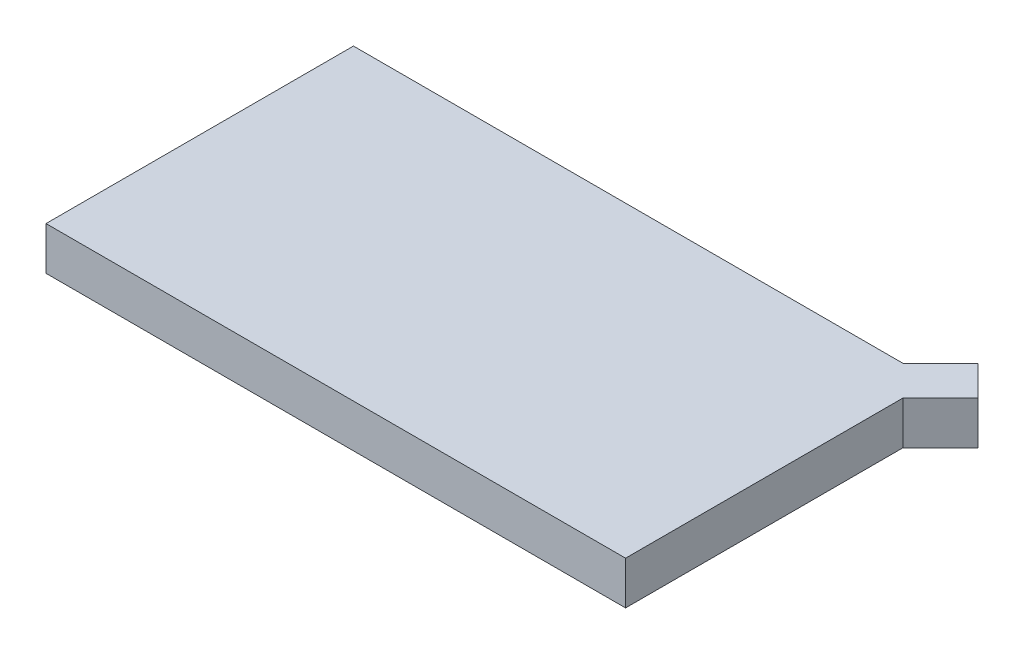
ISO-10303-21;
HEADER;
FILE_DESCRIPTION(('STEP AP214'),'2;1');
FILE_NAME('part.step','',(''),(''),'','','');
FILE_SCHEMA(('AUTOMOTIVE_DESIGN { 1 0 10303 214 1 1 1 1 }'));
ENDSEC;
DATA;
#1=APPLICATION_CONTEXT('core data for automotive mechanical design processes');
#2=APPLICATION_PROTOCOL_DEFINITION('international standard','automotive_design',2000,#1);
#3=PRODUCT_CONTEXT('',#1,'mechanical');
#4=PRODUCT('Part','Part','',(#3));
#5=PRODUCT_RELATED_PRODUCT_CATEGORY('part','',(#4));
#6=PRODUCT_DEFINITION_FORMATION('','',#4);
#7=PRODUCT_DEFINITION_CONTEXT('part definition',#1,'design');
#8=PRODUCT_DEFINITION('design','',#6,#7);
#9=PRODUCT_DEFINITION_SHAPE('','',#8);
#10=(LENGTH_UNIT() NAMED_UNIT(*) SI_UNIT(.MILLI.,.METRE.));
#11=(NAMED_UNIT(*) PLANE_ANGLE_UNIT() SI_UNIT($,.RADIAN.));
#12=(NAMED_UNIT(*) SI_UNIT($,.STERADIAN.) SOLID_ANGLE_UNIT());
#13=UNCERTAINTY_MEASURE_WITH_UNIT(LENGTH_MEASURE(1.E-05),#10,'distance_accuracy_value','');
#14=(GEOMETRIC_REPRESENTATION_CONTEXT(3) GLOBAL_UNCERTAINTY_ASSIGNED_CONTEXT((#13)) GLOBAL_UNIT_ASSIGNED_CONTEXT((#10,
#11,#12)) REPRESENTATION_CONTEXT('',''));
#15=CARTESIAN_POINT('',(0.,0.,0.));
#16=DIRECTION('',(0.,0.,1.));
#17=DIRECTION('',(1.,0.,0.));
#18=AXIS2_PLACEMENT_3D('',#15,#16,#17);
#19=CARTESIAN_POINT('',(136.041867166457,-0.38,-36.3991701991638));
#20=CARTESIAN_POINT('',(137.516132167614,-0.38,-33.5557413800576));
#21=CARTESIAN_POINT('',(138.82661552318,-0.38,-30.6745769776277));
#22=CARTESIAN_POINT('',(140.25135834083,-0.38,-27.7075059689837));
#23=B_SPLINE_CURVE_WITH_KNOTS('',3,(#19,#20,#21,#22),.UNSPECIFIED.,.F.,.F.,(4,4),(30.,31.),.UNSPECIFIED.);
#24=DIRECTION('',(0.,1.,0.));
#25=VECTOR('',#24,1.);
#26=SURFACE_OF_LINEAR_EXTRUSION('',#23,#25);
#27=CARTESIAN_POINT('',(136.041867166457,0.,-36.3991701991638));
#28=CARTESIAN_POINT('',(137.516132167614,0.,-33.5557413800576));
#29=CARTESIAN_POINT('',(138.82661552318,0.,-30.6745769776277));
#30=CARTESIAN_POINT('',(140.25135834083,0.,-27.7075059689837));
#31=B_SPLINE_CURVE_WITH_KNOTS('',3,(#27,#28,#29,#30),.UNSPECIFIED.,.F.,.F.,(4,4),(30.,31.),.UNSPECIFIED.);
#32=CARTESIAN_POINT('',(136.041867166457,0.,-36.3991701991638));
#33=VERTEX_POINT('',#32);
#34=CARTESIAN_POINT('',(140.25135834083,0.,-27.7075059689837));
#35=VERTEX_POINT('',#34);
#36=EDGE_CURVE('E219',#33,#35,#31,.T.);
#37=ORIENTED_EDGE('',*,*,#36,.T.);
#38=DIRECTION('',(0.,1.,0.));
#39=VECTOR('',#38,1.);
#40=CARTESIAN_POINT('',(140.25135834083,-0.38,-27.7075059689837));
#41=LINE('',#40,#39);
#42=CARTESIAN_POINT('',(140.25135834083,-0.38,-27.7075059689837));
#43=VERTEX_POINT('',#42);
#44=EDGE_CURVE('E13',#43,#35,#41,.T.);
#45=ORIENTED_EDGE('',*,*,#44,.F.);
#46=CARTESIAN_POINT('',(136.041867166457,-0.38,-36.3991701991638));
#47=CARTESIAN_POINT('',(137.516132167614,-0.38,-33.5557413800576));
#48=CARTESIAN_POINT('',(138.82661552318,-0.38,-30.6745769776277));
#49=CARTESIAN_POINT('',(140.25135834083,-0.38,-27.7075059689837));
#50=B_SPLINE_CURVE_WITH_KNOTS('',3,(#46,#47,#48,#49),.UNSPECIFIED.,.F.,.F.,(4,4),(30.,31.),.UNSPECIFIED.);
#51=CARTESIAN_POINT('',(136.041867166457,-0.38,-36.3991701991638));
#52=VERTEX_POINT('',#51);
#53=EDGE_CURVE('E195',#52,#43,#50,.T.);
#54=ORIENTED_EDGE('',*,*,#53,.F.);
#55=DIRECTION('',(0.,1.,0.));
#56=VECTOR('',#55,1.);
#57=CARTESIAN_POINT('',(136.041867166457,-0.38,-36.3991701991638));
#58=LINE('',#57,#56);
#59=EDGE_CURVE('E203',#52,#33,#58,.T.);
#60=ORIENTED_EDGE('',*,*,#59,.T.);
#61=EDGE_LOOP('',(#37,#45,#54,#60));
#62=FACE_BOUND('',#61,.T.);
#63=ADVANCED_FACE('F78',(#62),#26,.F.);
#64=CARTESIAN_POINT('',(140.25135834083,-0.38,-27.7075059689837));
#65=CARTESIAN_POINT('',(139.256695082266,-0.38,-27.5413881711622));
#66=CARTESIAN_POINT('',(138.46766666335,-0.38,-27.3960674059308));
#67=CARTESIAN_POINT('',(137.669466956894,-0.38,-27.2783837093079));
#68=B_SPLINE_CURVE_WITH_KNOTS('',3,(#64,#65,#66,#67),.UNSPECIFIED.,.F.,.F.,(4,4),(0.,1.),.UNSPECIFIED.);
#69=DIRECTION('',(0.,1.,0.));
#70=VECTOR('',#69,1.);
#71=SURFACE_OF_LINEAR_EXTRUSION('',#68,#70);
#72=CARTESIAN_POINT('',(140.25135834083,0.,-27.7075059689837));
#73=CARTESIAN_POINT('',(139.256695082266,0.,-27.5413881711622));
#74=CARTESIAN_POINT('',(138.46766666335,0.,-27.3960674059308));
#75=CARTESIAN_POINT('',(137.669466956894,0.,-27.2783837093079));
#76=B_SPLINE_CURVE_WITH_KNOTS('',3,(#72,#73,#74,#75),.UNSPECIFIED.,.F.,.F.,(4,4),(0.,1.),.UNSPECIFIED.);
#77=CARTESIAN_POINT('',(137.669466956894,0.,-27.2783837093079));
#78=VERTEX_POINT('',#77);
#79=EDGE_CURVE('E554',#35,#78,#76,.T.);
#80=ORIENTED_EDGE('',*,*,#79,.T.);
#81=DIRECTION('',(0.,1.,0.));
#82=VECTOR('',#81,1.);
#83=CARTESIAN_POINT('',(137.669466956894,-0.38,-27.2783837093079));
#84=LINE('',#83,#82);
#85=CARTESIAN_POINT('',(137.669466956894,-0.38,-27.2783837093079));
#86=VERTEX_POINT('',#85);
#87=EDGE_CURVE('E90',#86,#78,#84,.T.);
#88=ORIENTED_EDGE('',*,*,#87,.F.);
#89=CARTESIAN_POINT('',(140.25135834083,-0.38,-27.7075059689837));
#90=CARTESIAN_POINT('',(139.256695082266,-0.38,-27.5413881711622));
#91=CARTESIAN_POINT('',(138.46766666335,-0.38,-27.3960674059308));
#92=CARTESIAN_POINT('',(137.669466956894,-0.38,-27.2783837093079));
#93=B_SPLINE_CURVE_WITH_KNOTS('',3,(#89,#90,#91,#92),.UNSPECIFIED.,.F.,.F.,(4,4),(0.,1.),.UNSPECIFIED.);
#94=EDGE_CURVE('E569',#43,#86,#93,.T.);
#95=ORIENTED_EDGE('',*,*,#94,.F.);
#96=ORIENTED_EDGE('',*,*,#44,.T.);
#97=EDGE_LOOP('',(#80,#88,#95,#96));
#98=FACE_BOUND('',#97,.T.);
#99=ADVANCED_FACE('F245',(#98),#71,.F.);
#100=CARTESIAN_POINT('',(137.669466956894,-0.38,-27.2783837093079));
#101=CARTESIAN_POINT('',(128.824844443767,-0.38,-25.9743968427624));
#102=CARTESIAN_POINT('',(119.987780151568,-0.38,-24.6462760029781));
#103=CARTESIAN_POINT('',(111.124356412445,-0.38,-23.4016617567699));
#104=B_SPLINE_CURVE_WITH_KNOTS('',3,(#100,#101,#102,#103),.UNSPECIFIED.,.F.,.F.,(4,4),(1.,2.),.UNSPECIFIED.);
#105=DIRECTION('',(0.,1.,0.));
#106=VECTOR('',#105,1.);
#107=SURFACE_OF_LINEAR_EXTRUSION('',#104,#106);
#108=CARTESIAN_POINT('',(137.669466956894,0.,-27.2783837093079));
#109=CARTESIAN_POINT('',(128.824844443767,0.,-25.9743968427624));
#110=CARTESIAN_POINT('',(119.987780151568,0.,-24.6462760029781));
#111=CARTESIAN_POINT('',(111.124356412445,0.,-23.4016617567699));
#112=B_SPLINE_CURVE_WITH_KNOTS('',3,(#108,#109,#110,#111),.UNSPECIFIED.,.F.,.F.,(4,4),(1.,2.),.UNSPECIFIED.);
#113=CARTESIAN_POINT('',(111.124356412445,0.,-23.4016617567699));
#114=VERTEX_POINT('',#113);
#115=EDGE_CURVE('E558',#78,#114,#112,.T.);
#116=ORIENTED_EDGE('',*,*,#115,.T.);
#117=DIRECTION('',(0.,1.,0.));
#118=VECTOR('',#117,1.);
#119=CARTESIAN_POINT('',(111.124356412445,-0.38,-23.4016617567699));
#120=LINE('',#119,#118);
#121=CARTESIAN_POINT('',(111.124356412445,-0.38,-23.4016617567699));
#122=VERTEX_POINT('',#121);
#123=EDGE_CURVE('E582',#122,#114,#120,.T.);
#124=ORIENTED_EDGE('',*,*,#123,.F.);
#125=CARTESIAN_POINT('',(137.669466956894,-0.38,-27.2783837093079));
#126=CARTESIAN_POINT('',(128.824844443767,-0.38,-25.9743968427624));
#127=CARTESIAN_POINT('',(119.987780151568,-0.38,-24.6462760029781));
#128=CARTESIAN_POINT('',(111.124356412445,-0.38,-23.4016617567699));
#129=B_SPLINE_CURVE_WITH_KNOTS('',3,(#125,#126,#127,#128),.UNSPECIFIED.,.F.,.F.,(4,4),(1.,2.),.UNSPECIFIED.);
#130=EDGE_CURVE('E587',#86,#122,#129,.T.);
#131=ORIENTED_EDGE('',*,*,#130,.F.);
#132=ORIENTED_EDGE('',*,*,#87,.T.);
#133=EDGE_LOOP('',(#116,#124,#131,#132));
#134=FACE_BOUND('',#133,.T.);
#135=ADVANCED_FACE('F249',(#134),#107,.F.);
#136=CARTESIAN_POINT('',(111.124356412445,-0.38,-23.4016617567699));
#137=CARTESIAN_POINT('',(109.63880859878,-0.38,-23.1930545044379));
#138=CARTESIAN_POINT('',(109.166893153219,-0.38,-22.8353095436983));
#139=CARTESIAN_POINT('',(109.186668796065,-0.38,-21.8328381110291));
#140=B_SPLINE_CURVE_WITH_KNOTS('',3,(#136,#137,#138,#139),.UNSPECIFIED.,.F.,.F.,(4,4),(2.,3.),.UNSPECIFIED.);
#141=DIRECTION('',(0.,1.,0.));
#142=VECTOR('',#141,1.);
#143=SURFACE_OF_LINEAR_EXTRUSION('',#140,#142);
#144=CARTESIAN_POINT('',(111.124356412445,0.,-23.4016617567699));
#145=CARTESIAN_POINT('',(109.63880859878,0.,-23.1930545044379));
#146=CARTESIAN_POINT('',(109.166893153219,0.,-22.8353095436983));
#147=CARTESIAN_POINT('',(109.186668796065,0.,-21.8328381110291));
#148=B_SPLINE_CURVE_WITH_KNOTS('',3,(#144,#145,#146,#147),.UNSPECIFIED.,.F.,.F.,(4,4),(2.,3.),.UNSPECIFIED.);
#149=CARTESIAN_POINT('',(109.186668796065,0.,-21.8328381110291));
#150=VERTEX_POINT('',#149);
#151=EDGE_CURVE('E595',#114,#150,#148,.T.);
#152=ORIENTED_EDGE('',*,*,#151,.T.);
#153=DIRECTION('',(0.,1.,0.));
#154=VECTOR('',#153,1.);
#155=CARTESIAN_POINT('',(109.186668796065,-0.38,-21.8328381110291));
#156=LINE('',#155,#154);
#157=CARTESIAN_POINT('',(109.186668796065,-0.38,-21.8328381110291));
#158=VERTEX_POINT('',#157);
#159=EDGE_CURVE('E601',#158,#150,#156,.T.);
#160=ORIENTED_EDGE('',*,*,#159,.F.);
#161=CARTESIAN_POINT('',(111.124356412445,-0.38,-23.4016617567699));
#162=CARTESIAN_POINT('',(109.63880859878,-0.38,-23.1930545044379));
#163=CARTESIAN_POINT('',(109.166893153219,-0.38,-22.8353095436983));
#164=CARTESIAN_POINT('',(109.186668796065,-0.38,-21.8328381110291));
#165=B_SPLINE_CURVE_WITH_KNOTS('',3,(#161,#162,#163,#164),.UNSPECIFIED.,.F.,.F.,(4,4),(2.,3.),.UNSPECIFIED.);
#166=EDGE_CURVE('E606',#122,#158,#165,.T.);
#167=ORIENTED_EDGE('',*,*,#166,.F.);
#168=ORIENTED_EDGE('',*,*,#123,.T.);
#169=EDGE_LOOP('',(#152,#160,#167,#168));
#170=FACE_BOUND('',#169,.T.);
#171=ADVANCED_FACE('F253',(#170),#143,.F.);
#172=CARTESIAN_POINT('',(109.186668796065,-0.38,-21.8328381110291));
#173=CARTESIAN_POINT('',(109.267183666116,-0.38,-17.7507350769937));
#174=CARTESIAN_POINT('',(109.163532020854,-0.38,-13.6668597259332));
#175=CARTESIAN_POINT('',(109.269011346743,-0.38,-9.58525977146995));
#176=B_SPLINE_CURVE_WITH_KNOTS('',3,(#172,#173,#174,#175),.UNSPECIFIED.,.F.,.F.,(4,4),(3.,4.),.UNSPECIFIED.);
#177=DIRECTION('',(0.,1.,0.));
#178=VECTOR('',#177,1.);
#179=SURFACE_OF_LINEAR_EXTRUSION('',#176,#178);
#180=CARTESIAN_POINT('',(109.186668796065,0.,-21.8328381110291));
#181=CARTESIAN_POINT('',(109.267183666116,0.,-17.7507350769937));
#182=CARTESIAN_POINT('',(109.163532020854,0.,-13.6668597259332));
#183=CARTESIAN_POINT('',(109.269011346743,0.,-9.58525977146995));
#184=B_SPLINE_CURVE_WITH_KNOTS('',3,(#180,#181,#182,#183),.UNSPECIFIED.,.F.,.F.,(4,4),(3.,4.),.UNSPECIFIED.);
#185=CARTESIAN_POINT('',(109.269011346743,0.,-9.58525977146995));
#186=VERTEX_POINT('',#185);
#187=EDGE_CURVE('E614',#150,#186,#184,.T.);
#188=ORIENTED_EDGE('',*,*,#187,.T.);
#189=DIRECTION('',(0.,1.,0.));
#190=VECTOR('',#189,1.);
#191=CARTESIAN_POINT('',(109.269011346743,-0.38,-9.58525977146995));
#192=LINE('',#191,#190);
#193=CARTESIAN_POINT('',(109.269011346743,-0.38,-9.58525977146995));
#194=VERTEX_POINT('',#193);
#195=EDGE_CURVE('E620',#194,#186,#192,.T.);
#196=ORIENTED_EDGE('',*,*,#195,.F.);
#197=CARTESIAN_POINT('',(109.186668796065,-0.38,-21.8328381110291));
#198=CARTESIAN_POINT('',(109.267183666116,-0.38,-17.7507350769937));
#199=CARTESIAN_POINT('',(109.163532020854,-0.38,-13.6668597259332));
#200=CARTESIAN_POINT('',(109.269011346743,-0.38,-9.58525977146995));
#201=B_SPLINE_CURVE_WITH_KNOTS('',3,(#197,#198,#199,#200),.UNSPECIFIED.,.F.,.F.,(4,4),(3.,4.),.UNSPECIFIED.);
#202=EDGE_CURVE('E625',#158,#194,#201,.T.);
#203=ORIENTED_EDGE('',*,*,#202,.F.);
#204=ORIENTED_EDGE('',*,*,#159,.T.);
#205=EDGE_LOOP('',(#188,#196,#203,#204));
#206=FACE_BOUND('',#205,.T.);
#207=ADVANCED_FACE('F281',(#206),#179,.F.);
#208=CARTESIAN_POINT('',(109.269011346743,-0.38,-9.58525977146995));
#209=CARTESIAN_POINT('',(109.289531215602,-0.38,-8.79097558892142));
#210=CARTESIAN_POINT('',(109.728313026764,-0.38,-7.91967407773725));
#211=CARTESIAN_POINT('',(110.343275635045,-0.38,-7.23022660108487));
#212=B_SPLINE_CURVE_WITH_KNOTS('',3,(#208,#209,#210,#211),.UNSPECIFIED.,.F.,.F.,(4,4),(4.,5.),.UNSPECIFIED.);
#213=DIRECTION('',(0.,1.,0.));
#214=VECTOR('',#213,1.);
#215=SURFACE_OF_LINEAR_EXTRUSION('',#212,#214);
#216=CARTESIAN_POINT('',(109.269011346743,0.,-9.58525977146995));
#217=CARTESIAN_POINT('',(109.289531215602,0.,-8.79097558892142));
#218=CARTESIAN_POINT('',(109.728313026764,0.,-7.91967407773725));
#219=CARTESIAN_POINT('',(110.343275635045,0.,-7.23022660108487));
#220=B_SPLINE_CURVE_WITH_KNOTS('',3,(#216,#217,#218,#219),.UNSPECIFIED.,.F.,.F.,(4,4),(4.,5.),.UNSPECIFIED.);
#221=CARTESIAN_POINT('',(110.343275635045,0.,-7.23022660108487));
#222=VERTEX_POINT('',#221);
#223=EDGE_CURVE('E633',#186,#222,#220,.T.);
#224=ORIENTED_EDGE('',*,*,#223,.T.);
#225=DIRECTION('',(0.,1.,0.));
#226=VECTOR('',#225,1.);
#227=CARTESIAN_POINT('',(110.343275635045,-0.38,-7.23022660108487));
#228=LINE('',#227,#226);
#229=CARTESIAN_POINT('',(110.343275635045,-0.38,-7.23022660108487));
#230=VERTEX_POINT('',#229);
#231=EDGE_CURVE('E639',#230,#222,#228,.T.);
#232=ORIENTED_EDGE('',*,*,#231,.F.);
#233=CARTESIAN_POINT('',(109.269011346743,-0.38,-9.58525977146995));
#234=CARTESIAN_POINT('',(109.289531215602,-0.38,-8.79097558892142));
#235=CARTESIAN_POINT('',(109.728313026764,-0.38,-7.91967407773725));
#236=CARTESIAN_POINT('',(110.343275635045,-0.38,-7.23022660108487));
#237=B_SPLINE_CURVE_WITH_KNOTS('',3,(#233,#234,#235,#236),.UNSPECIFIED.,.F.,.F.,(4,4),(4.,5.),.UNSPECIFIED.);
#238=EDGE_CURVE('E644',#194,#230,#237,.T.);
#239=ORIENTED_EDGE('',*,*,#238,.F.);
#240=ORIENTED_EDGE('',*,*,#195,.T.);
#241=EDGE_LOOP('',(#224,#232,#239,#240));
#242=FACE_BOUND('',#241,.T.);
#243=ADVANCED_FACE('F284',(#242),#215,.F.);
#244=CARTESIAN_POINT('',(110.343275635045,-0.38,-7.23022660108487));
#245=CARTESIAN_POINT('',(111.85405097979,-0.38,-5.53645229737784));
#246=CARTESIAN_POINT('',(113.579914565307,-0.38,-3.9279499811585));
#247=CARTESIAN_POINT('',(115.484783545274,-0.38,-2.0190630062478));
#248=B_SPLINE_CURVE_WITH_KNOTS('',3,(#244,#245,#246,#247),.UNSPECIFIED.,.F.,.F.,(4,4),(5.,6.),.UNSPECIFIED.);
#249=DIRECTION('',(0.,1.,0.));
#250=VECTOR('',#249,1.);
#251=SURFACE_OF_LINEAR_EXTRUSION('',#248,#250);
#252=CARTESIAN_POINT('',(110.343275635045,0.,-7.23022660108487));
#253=CARTESIAN_POINT('',(111.85405097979,0.,-5.53645229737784));
#254=CARTESIAN_POINT('',(113.579914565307,0.,-3.9279499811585));
#255=CARTESIAN_POINT('',(115.484783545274,0.,-2.0190630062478));
#256=B_SPLINE_CURVE_WITH_KNOTS('',3,(#252,#253,#254,#255),.UNSPECIFIED.,.F.,.F.,(4,4),(5.,6.),.UNSPECIFIED.);
#257=CARTESIAN_POINT('',(115.484783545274,0.,-2.0190630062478));
#258=VERTEX_POINT('',#257);
#259=EDGE_CURVE('E652',#222,#258,#256,.T.);
#260=ORIENTED_EDGE('',*,*,#259,.T.);
#261=DIRECTION('',(0.,1.,0.));
#262=VECTOR('',#261,1.);
#263=CARTESIAN_POINT('',(115.484783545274,-0.38,-2.0190630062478));
#264=LINE('',#263,#262);
#265=CARTESIAN_POINT('',(115.484783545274,-0.38,-2.0190630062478));
#266=VERTEX_POINT('',#265);
#267=EDGE_CURVE('E658',#266,#258,#264,.T.);
#268=ORIENTED_EDGE('',*,*,#267,.F.);
#269=CARTESIAN_POINT('',(110.343275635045,-0.38,-7.23022660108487));
#270=CARTESIAN_POINT('',(111.85405097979,-0.38,-5.53645229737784));
#271=CARTESIAN_POINT('',(113.579914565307,-0.38,-3.9279499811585));
#272=CARTESIAN_POINT('',(115.484783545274,-0.38,-2.0190630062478));
#273=B_SPLINE_CURVE_WITH_KNOTS('',3,(#269,#270,#271,#272),.UNSPECIFIED.,.F.,.F.,(4,4),(5.,6.),.UNSPECIFIED.);
#274=EDGE_CURVE('E663',#230,#266,#273,.T.);
#275=ORIENTED_EDGE('',*,*,#274,.F.);
#276=ORIENTED_EDGE('',*,*,#231,.T.);
#277=EDGE_LOOP('',(#260,#268,#275,#276));
#278=FACE_BOUND('',#277,.T.);
#279=ADVANCED_FACE('F288',(#278),#251,.F.);
#280=CARTESIAN_POINT('',(-43.0101793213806,-0.38,-2.01906300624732));
#281=DIRECTION('',(0.,0.,-1.));
#282=DIRECTION('',(-1.,0.,0.));
#283=AXIS2_PLACEMENT_3D('',#280,#281,#282);
#284=PLANE('',#283);
#285=DIRECTION('',(-1.,0.,0.));
#286=VECTOR('',#285,1.);
#287=CARTESIAN_POINT('',(-43.0101793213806,0.,-2.01906300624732));
#288=LINE('',#287,#286);
#289=CARTESIAN_POINT('',(112.682582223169,0.,-2.01906300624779));
#290=VERTEX_POINT('',#289);
#291=EDGE_CURVE('E671',#258,#290,#288,.T.);
#292=ORIENTED_EDGE('',*,*,#291,.T.);
#293=DIRECTION('',(0.,1.,0.));
#294=VECTOR('',#293,1.);
#295=CARTESIAN_POINT('',(112.682582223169,-0.38,-2.01906300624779));
#296=LINE('',#295,#294);
#297=CARTESIAN_POINT('',(112.682582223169,-0.38,-2.01906300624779));
#298=VERTEX_POINT('',#297);
#299=EDGE_CURVE('E677',#298,#290,#296,.T.);
#300=ORIENTED_EDGE('',*,*,#299,.F.);
#301=DIRECTION('',(-1.,0.,0.));
#302=VECTOR('',#301,1.);
#303=CARTESIAN_POINT('',(-43.0101793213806,-0.38,-2.01906300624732));
#304=LINE('',#303,#302);
#305=EDGE_CURVE('E682',#266,#298,#304,.T.);
#306=ORIENTED_EDGE('',*,*,#305,.F.);
#307=ORIENTED_EDGE('',*,*,#267,.T.);
#308=EDGE_LOOP('',(#292,#300,#306,#307));
#309=FACE_BOUND('',#308,.T.);
#310=ADVANCED_FACE('F292',(#309),#284,.F.);
#311=CARTESIAN_POINT('',(112.682582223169,-0.38,-2.01906300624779));
#312=CARTESIAN_POINT('',(76.6939064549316,-0.38,-2.01907223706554));
#313=CARTESIAN_POINT('',(40.7052341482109,-0.38,-2.01885069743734));
#314=CARTESIAN_POINT('',(4.71655491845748,-0.38,-2.02082378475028));
#315=B_SPLINE_CURVE_WITH_KNOTS('',3,(#311,#312,#313,#314),.UNSPECIFIED.,.F.,.F.,(4,4),(7.,8.),.UNSPECIFIED.);
#316=DIRECTION('',(0.,1.,0.));
#317=VECTOR('',#316,1.);
#318=SURFACE_OF_LINEAR_EXTRUSION('',#315,#317);
#319=CARTESIAN_POINT('',(112.682582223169,0.,-2.01906300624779));
#320=CARTESIAN_POINT('',(76.6939064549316,0.,-2.01907223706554));
#321=CARTESIAN_POINT('',(40.7052341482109,0.,-2.01885069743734));
#322=CARTESIAN_POINT('',(4.71655491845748,0.,-2.02082378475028));
#323=B_SPLINE_CURVE_WITH_KNOTS('',3,(#319,#320,#321,#322),.UNSPECIFIED.,.F.,.F.,(4,4),(7.,8.),.UNSPECIFIED.);
#324=CARTESIAN_POINT('',(4.71655491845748,0.,-2.02082378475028));
#325=VERTEX_POINT('',#324);
#326=EDGE_CURVE('E688',#290,#325,#323,.T.);
#327=ORIENTED_EDGE('',*,*,#326,.T.);
#328=DIRECTION('',(0.,1.,0.));
#329=VECTOR('',#328,1.);
#330=CARTESIAN_POINT('',(4.71655491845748,-0.38,-2.02082378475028));
#331=LINE('',#330,#329);
#332=CARTESIAN_POINT('',(4.71655491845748,-0.38,-2.02082378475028));
#333=VERTEX_POINT('',#332);
#334=EDGE_CURVE('E691',#333,#325,#331,.T.);
#335=ORIENTED_EDGE('',*,*,#334,.F.);
#336=CARTESIAN_POINT('',(112.682582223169,-0.38,-2.01906300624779));
#337=CARTESIAN_POINT('',(76.6939064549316,-0.38,-2.01907223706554));
#338=CARTESIAN_POINT('',(40.7052341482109,-0.38,-2.01885069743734));
#339=CARTESIAN_POINT('',(4.71655491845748,-0.38,-2.02082378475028));
#340=B_SPLINE_CURVE_WITH_KNOTS('',3,(#336,#337,#338,#339),.UNSPECIFIED.,.F.,.F.,(4,4),(7.,8.),.UNSPECIFIED.);
#341=EDGE_CURVE('E694',#298,#333,#340,.T.);
#342=ORIENTED_EDGE('',*,*,#341,.F.);
#343=ORIENTED_EDGE('',*,*,#299,.T.);
#344=EDGE_LOOP('',(#327,#335,#342,#343));
#345=FACE_BOUND('',#344,.T.);
#346=ADVANCED_FACE('F313',(#345),#318,.F.);
#347=CARTESIAN_POINT('',(4.71655491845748,-0.38,-2.02082378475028));
#348=CARTESIAN_POINT('',(4.03718387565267,-0.38,-2.02086070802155));
#349=CARTESIAN_POINT('',(3.3499482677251,-0.38,-2.00794217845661));
#350=CARTESIAN_POINT('',(2.67988178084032,-0.38,-2.06798172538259));
#351=B_SPLINE_CURVE_WITH_KNOTS('',3,(#347,#348,#349,#350),.UNSPECIFIED.,.F.,.F.,(4,4),(8.,9.),.UNSPECIFIED.);
#352=DIRECTION('',(0.,1.,0.));
#353=VECTOR('',#352,1.);
#354=SURFACE_OF_LINEAR_EXTRUSION('',#351,#353);
#355=CARTESIAN_POINT('',(4.71655491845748,0.,-2.02082378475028));
#356=CARTESIAN_POINT('',(4.03718387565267,0.,-2.02086070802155));
#357=CARTESIAN_POINT('',(3.3499482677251,0.,-2.00794217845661));
#358=CARTESIAN_POINT('',(2.67988178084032,0.,-2.06798172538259));
#359=B_SPLINE_CURVE_WITH_KNOTS('',3,(#355,#356,#357,#358),.UNSPECIFIED.,.F.,.F.,(4,4),(8.,9.),.UNSPECIFIED.);
#360=CARTESIAN_POINT('',(2.67988178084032,0.,-2.06798172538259));
#361=VERTEX_POINT('',#360);
#362=EDGE_CURVE('E699',#325,#361,#359,.T.);
#363=ORIENTED_EDGE('',*,*,#362,.T.);
#364=DIRECTION('',(0.,1.,0.));
#365=VECTOR('',#364,1.);
#366=CARTESIAN_POINT('',(2.67988178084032,-0.38,-2.06798172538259));
#367=LINE('',#366,#365);
#368=CARTESIAN_POINT('',(2.67988178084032,-0.38,-2.06798172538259));
#369=VERTEX_POINT('',#368);
#370=EDGE_CURVE('E705',#369,#361,#367,.T.);
#371=ORIENTED_EDGE('',*,*,#370,.F.);
#372=CARTESIAN_POINT('',(4.71655491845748,-0.38,-2.02082378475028));
#373=CARTESIAN_POINT('',(4.03718387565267,-0.38,-2.02086070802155));
#374=CARTESIAN_POINT('',(3.3499482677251,-0.38,-2.00794217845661));
#375=CARTESIAN_POINT('',(2.67988178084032,-0.38,-2.06798172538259));
#376=B_SPLINE_CURVE_WITH_KNOTS('',3,(#372,#373,#374,#375),.UNSPECIFIED.,.F.,.F.,(4,4),(8.,9.),.UNSPECIFIED.);
#377=EDGE_CURVE('E710',#333,#369,#376,.T.);
#378=ORIENTED_EDGE('',*,*,#377,.F.);
#379=ORIENTED_EDGE('',*,*,#334,.T.);
#380=EDGE_LOOP('',(#363,#371,#378,#379));
#381=FACE_BOUND('',#380,.T.);
#382=ADVANCED_FACE('F316',(#381),#354,.F.);
#383=CARTESIAN_POINT('',(2.67988178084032,-0.38,-2.06798172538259));
#384=CARTESIAN_POINT('',(0.531747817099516,-0.38,-2.26045350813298));
#385=CARTESIAN_POINT('',(-0.0441377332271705,-0.38,-2.94400710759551));
#386=CARTESIAN_POINT('',(0.779066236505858,-0.38,-4.26579329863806));
#387=B_SPLINE_CURVE_WITH_KNOTS('',3,(#383,#384,#385,#386),.UNSPECIFIED.,.F.,.F.,(4,4),(9.,10.),.UNSPECIFIED.);
#388=DIRECTION('',(0.,1.,0.));
#389=VECTOR('',#388,1.);
#390=SURFACE_OF_LINEAR_EXTRUSION('',#387,#389);
#391=CARTESIAN_POINT('',(2.67988178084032,0.,-2.06798172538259));
#392=CARTESIAN_POINT('',(0.531747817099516,0.,-2.26045350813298));
#393=CARTESIAN_POINT('',(-0.0441377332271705,0.,-2.94400710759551));
#394=CARTESIAN_POINT('',(0.779066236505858,0.,-4.26579329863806));
#395=B_SPLINE_CURVE_WITH_KNOTS('',3,(#391,#392,#393,#394),.UNSPECIFIED.,.F.,.F.,(4,4),(9.,10.),.UNSPECIFIED.);
#396=CARTESIAN_POINT('',(0.779066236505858,0.,-4.26579329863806));
#397=VERTEX_POINT('',#396);
#398=EDGE_CURVE('E718',#361,#397,#395,.T.);
#399=ORIENTED_EDGE('',*,*,#398,.T.);
#400=DIRECTION('',(0.,1.,0.));
#401=VECTOR('',#400,1.);
#402=CARTESIAN_POINT('',(0.779066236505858,-0.38,-4.26579329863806));
#403=LINE('',#402,#401);
#404=CARTESIAN_POINT('',(0.779066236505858,-0.38,-4.26579329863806));
#405=VERTEX_POINT('',#404);
#406=EDGE_CURVE('E724',#405,#397,#403,.T.);
#407=ORIENTED_EDGE('',*,*,#406,.F.);
#408=CARTESIAN_POINT('',(2.67988178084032,-0.38,-2.06798172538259));
#409=CARTESIAN_POINT('',(0.531747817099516,-0.38,-2.26045350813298));
#410=CARTESIAN_POINT('',(-0.0441377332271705,-0.38,-2.94400710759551));
#411=CARTESIAN_POINT('',(0.779066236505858,-0.38,-4.26579329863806));
#412=B_SPLINE_CURVE_WITH_KNOTS('',3,(#408,#409,#410,#411),.UNSPECIFIED.,.F.,.F.,(4,4),(9.,10.),.UNSPECIFIED.);
#413=EDGE_CURVE('E729',#369,#405,#412,.T.);
#414=ORIENTED_EDGE('',*,*,#413,.F.);
#415=ORIENTED_EDGE('',*,*,#370,.T.);
#416=EDGE_LOOP('',(#399,#407,#414,#415));
#417=FACE_BOUND('',#416,.T.);
#418=ADVANCED_FACE('F320',(#417),#390,.F.);
#419=CARTESIAN_POINT('',(0.779066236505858,-0.38,-4.26579329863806));
#420=CARTESIAN_POINT('',(2.29138887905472,-0.38,-6.69409608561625));
#421=CARTESIAN_POINT('',(4.01440709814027,-0.38,-7.46498014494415));
#422=CARTESIAN_POINT('',(7.92994976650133,-0.38,-7.46502168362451));
#423=B_SPLINE_CURVE_WITH_KNOTS('',3,(#419,#420,#421,#422),.UNSPECIFIED.,.F.,.F.,(4,4),(10.,11.),.UNSPECIFIED.);
#424=DIRECTION('',(0.,1.,0.));
#425=VECTOR('',#424,1.);
#426=SURFACE_OF_LINEAR_EXTRUSION('',#423,#425);
#427=CARTESIAN_POINT('',(0.779066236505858,0.,-4.26579329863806));
#428=CARTESIAN_POINT('',(2.29138887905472,0.,-6.69409608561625));
#429=CARTESIAN_POINT('',(4.01440709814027,0.,-7.46498014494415));
#430=CARTESIAN_POINT('',(7.92994976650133,0.,-7.46502168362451));
#431=B_SPLINE_CURVE_WITH_KNOTS('',3,(#427,#428,#429,#430),.UNSPECIFIED.,.F.,.F.,(4,4),(10.,11.),.UNSPECIFIED.);
#432=CARTESIAN_POINT('',(7.92994976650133,0.,-7.46502168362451));
#433=VERTEX_POINT('',#432);
#434=EDGE_CURVE('E737',#397,#433,#431,.T.);
#435=ORIENTED_EDGE('',*,*,#434,.T.);
#436=DIRECTION('',(0.,1.,0.));
#437=VECTOR('',#436,1.);
#438=CARTESIAN_POINT('',(7.92994976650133,-0.38,-7.46502168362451));
#439=LINE('',#438,#437);
#440=CARTESIAN_POINT('',(7.92994976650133,-0.38,-7.46502168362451));
#441=VERTEX_POINT('',#440);
#442=EDGE_CURVE('E743',#441,#433,#439,.T.);
#443=ORIENTED_EDGE('',*,*,#442,.F.);
#444=CARTESIAN_POINT('',(0.779066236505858,-0.38,-4.26579329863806));
#445=CARTESIAN_POINT('',(2.29138887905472,-0.38,-6.69409608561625));
#446=CARTESIAN_POINT('',(4.01440709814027,-0.38,-7.46498014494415));
#447=CARTESIAN_POINT('',(7.92994976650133,-0.38,-7.46502168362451));
#448=B_SPLINE_CURVE_WITH_KNOTS('',3,(#444,#445,#446,#447),.UNSPECIFIED.,.F.,.F.,(4,4),(10.,11.),.UNSPECIFIED.);
#449=EDGE_CURVE('E748',#405,#441,#448,.T.);
#450=ORIENTED_EDGE('',*,*,#449,.F.);
#451=ORIENTED_EDGE('',*,*,#406,.T.);
#452=EDGE_LOOP('',(#435,#443,#450,#451));
#453=FACE_BOUND('',#452,.T.);
#454=ADVANCED_FACE('F324',(#453),#426,.F.);
#455=CARTESIAN_POINT('',(7.92994976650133,-0.38,-7.46502168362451));
#456=CARTESIAN_POINT('',(11.2156487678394,-0.38,-7.46505629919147));
#457=CARTESIAN_POINT('',(14.5013339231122,-0.38,-7.46502860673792));
#458=CARTESIAN_POINT('',(17.760448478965,-0.38,-7.46502860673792));
#459=B_SPLINE_CURVE_WITH_KNOTS('',3,(#455,#456,#457,#458),.UNSPECIFIED.,.F.,.F.,(4,4),(11.,12.),.UNSPECIFIED.);
#460=DIRECTION('',(0.,1.,0.));
#461=VECTOR('',#460,1.);
#462=SURFACE_OF_LINEAR_EXTRUSION('',#459,#461);
#463=CARTESIAN_POINT('',(7.92994976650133,0.,-7.46502168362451));
#464=CARTESIAN_POINT('',(11.2156487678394,0.,-7.46505629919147));
#465=CARTESIAN_POINT('',(14.5013339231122,0.,-7.46502860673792));
#466=CARTESIAN_POINT('',(17.760448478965,0.,-7.46502860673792));
#467=B_SPLINE_CURVE_WITH_KNOTS('',3,(#463,#464,#465,#466),.UNSPECIFIED.,.F.,.F.,(4,4),(11.,12.),.UNSPECIFIED.);
#468=CARTESIAN_POINT('',(17.760448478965,0.,-7.46502860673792));
#469=VERTEX_POINT('',#468);
#470=EDGE_CURVE('E756',#433,#469,#467,.T.);
#471=ORIENTED_EDGE('',*,*,#470,.T.);
#472=DIRECTION('',(0.,1.,0.));
#473=VECTOR('',#472,1.);
#474=CARTESIAN_POINT('',(17.760448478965,-0.38,-7.46502860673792));
#475=LINE('',#474,#473);
#476=CARTESIAN_POINT('',(17.760448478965,-0.38,-7.46502860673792));
#477=VERTEX_POINT('',#476);
#478=EDGE_CURVE('E762',#477,#469,#475,.T.);
#479=ORIENTED_EDGE('',*,*,#478,.F.);
#480=CARTESIAN_POINT('',(7.92994976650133,-0.38,-7.46502168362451));
#481=CARTESIAN_POINT('',(11.2156487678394,-0.38,-7.46505629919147));
#482=CARTESIAN_POINT('',(14.5013339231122,-0.38,-7.46502860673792));
#483=CARTESIAN_POINT('',(17.760448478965,-0.38,-7.46502860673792));
#484=B_SPLINE_CURVE_WITH_KNOTS('',3,(#480,#481,#482,#483),.UNSPECIFIED.,.F.,.F.,(4,4),(11.,12.),.UNSPECIFIED.);
#485=EDGE_CURVE('E767',#441,#477,#484,.T.);
#486=ORIENTED_EDGE('',*,*,#485,.F.);
#487=ORIENTED_EDGE('',*,*,#442,.T.);
#488=EDGE_LOOP('',(#471,#479,#486,#487));
#489=FACE_BOUND('',#488,.T.);
#490=ADVANCED_FACE('F352',(#489),#462,.F.);
#491=CARTESIAN_POINT('',(17.760448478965,-0.38,3.42969524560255));
#492=DIRECTION('',(1.,0.,0.));
#493=DIRECTION('',(0.,0.,-1.));
#494=AXIS2_PLACEMENT_3D('',#491,#492,#493);
#495=PLANE('',#494);
#496=DIRECTION('',(0.,0.,-1.));
#497=VECTOR('',#496,1.);
#498=CARTESIAN_POINT('',(17.760448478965,0.,3.42969524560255));
#499=LINE('',#498,#497);
#500=CARTESIAN_POINT('',(17.7604484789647,0.,-62.8167462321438));
#501=VERTEX_POINT('',#500);
#502=EDGE_CURVE('E775',#469,#501,#499,.T.);
#503=ORIENTED_EDGE('',*,*,#502,.T.);
#504=DIRECTION('',(0.,1.,0.));
#505=VECTOR('',#504,1.);
#506=CARTESIAN_POINT('',(17.7604484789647,-0.38,-62.8167462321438));
#507=LINE('',#506,#505);
#508=CARTESIAN_POINT('',(17.7604484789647,-0.38,-62.8167462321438));
#509=VERTEX_POINT('',#508);
#510=EDGE_CURVE('E781',#509,#501,#507,.T.);
#511=ORIENTED_EDGE('',*,*,#510,.F.);
#512=DIRECTION('',(0.,0.,-1.));
#513=VECTOR('',#512,1.);
#514=CARTESIAN_POINT('',(17.760448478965,-0.38,3.42969524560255));
#515=LINE('',#514,#513);
#516=EDGE_CURVE('E786',#477,#509,#515,.T.);
#517=ORIENTED_EDGE('',*,*,#516,.F.);
#518=ORIENTED_EDGE('',*,*,#478,.T.);
#519=EDGE_LOOP('',(#503,#511,#517,#518));
#520=FACE_BOUND('',#519,.T.);
#521=ADVANCED_FACE('F355',(#520),#495,.F.);
#522=CARTESIAN_POINT('',(17.7604484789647,-0.38,-62.8167462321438));
#523=CARTESIAN_POINT('',(15.0116722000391,-0.38,-62.8167462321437));
#524=CARTESIAN_POINT('',(12.4503439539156,-0.38,-62.8047184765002));
#525=CARTESIAN_POINT('',(9.88951416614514,-0.38,-62.8236878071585));
#526=B_SPLINE_CURVE_WITH_KNOTS('',3,(#522,#523,#524,#525),.UNSPECIFIED.,.F.,.F.,(4,4),(13.,14.),.UNSPECIFIED.);
#527=DIRECTION('',(0.,1.,0.));
#528=VECTOR('',#527,1.);
#529=SURFACE_OF_LINEAR_EXTRUSION('',#526,#528);
#530=CARTESIAN_POINT('',(17.7604484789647,0.,-62.8167462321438));
#531=CARTESIAN_POINT('',(15.0116722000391,0.,-62.8167462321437));
#532=CARTESIAN_POINT('',(12.4503439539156,0.,-62.8047184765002));
#533=CARTESIAN_POINT('',(9.88951416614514,0.,-62.8236878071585));
#534=B_SPLINE_CURVE_WITH_KNOTS('',3,(#530,#531,#532,#533),.UNSPECIFIED.,.F.,.F.,(4,4),(13.,14.),.UNSPECIFIED.);
#535=CARTESIAN_POINT('',(9.88951416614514,0.,-62.8236878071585));
#536=VERTEX_POINT('',#535);
#537=EDGE_CURVE('E792',#501,#536,#534,.T.);
#538=ORIENTED_EDGE('',*,*,#537,.T.);
#539=DIRECTION('',(0.,1.,0.));
#540=VECTOR('',#539,1.);
#541=CARTESIAN_POINT('',(9.88951416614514,-0.38,-62.8236878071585));
#542=LINE('',#541,#540);
#543=CARTESIAN_POINT('',(9.88951416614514,-0.38,-62.8236878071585));
#544=VERTEX_POINT('',#543);
#545=EDGE_CURVE('E795',#544,#536,#542,.T.);
#546=ORIENTED_EDGE('',*,*,#545,.F.);
#547=CARTESIAN_POINT('',(17.7604484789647,-0.38,-62.8167462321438));
#548=CARTESIAN_POINT('',(15.0116722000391,-0.38,-62.8167462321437));
#549=CARTESIAN_POINT('',(12.4503439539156,-0.38,-62.8047184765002));
#550=CARTESIAN_POINT('',(9.88951416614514,-0.38,-62.8236878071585));
#551=B_SPLINE_CURVE_WITH_KNOTS('',3,(#547,#548,#549,#550),.UNSPECIFIED.,.F.,.F.,(4,4),(13.,14.),.UNSPECIFIED.);
#552=EDGE_CURVE('E798',#509,#544,#551,.T.);
#553=ORIENTED_EDGE('',*,*,#552,.F.);
#554=ORIENTED_EDGE('',*,*,#510,.T.);
#555=EDGE_LOOP('',(#538,#546,#553,#554));
#556=FACE_BOUND('',#555,.T.);
#557=ADVANCED_FACE('F359',(#556),#529,.F.);
#558=CARTESIAN_POINT('',(9.88951416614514,-0.38,-62.8236878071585));
#559=CARTESIAN_POINT('',(9.06420559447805,-0.38,-62.8297986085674));
#560=CARTESIAN_POINT('',(8.104880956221,-0.38,-62.7614444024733));
#561=CARTESIAN_POINT('',(7.45418511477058,-0.38,-63.0123011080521));
#562=B_SPLINE_CURVE_WITH_KNOTS('',3,(#558,#559,#560,#561),.UNSPECIFIED.,.F.,.F.,(4,4),(14.,15.),.UNSPECIFIED.);
#563=DIRECTION('',(0.,1.,0.));
#564=VECTOR('',#563,1.);
#565=SURFACE_OF_LINEAR_EXTRUSION('',#562,#564);
#566=CARTESIAN_POINT('',(9.88951416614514,0.,-62.8236878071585));
#567=CARTESIAN_POINT('',(9.06420559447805,0.,-62.8297986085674));
#568=CARTESIAN_POINT('',(8.104880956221,0.,-62.7614444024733));
#569=CARTESIAN_POINT('',(7.45418511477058,0.,-63.0123011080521));
#570=B_SPLINE_CURVE_WITH_KNOTS('',3,(#566,#567,#568,#569),.UNSPECIFIED.,.F.,.F.,(4,4),(14.,15.),.UNSPECIFIED.);
#571=CARTESIAN_POINT('',(7.45418511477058,0.,-63.0123011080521));
#572=VERTEX_POINT('',#571);
#573=EDGE_CURVE('E803',#536,#572,#570,.T.);
#574=ORIENTED_EDGE('',*,*,#573,.T.);
#575=DIRECTION('',(0.,1.,0.));
#576=VECTOR('',#575,1.);
#577=CARTESIAN_POINT('',(7.45418511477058,-0.38,-63.0123011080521));
#578=LINE('',#577,#576);
#579=CARTESIAN_POINT('',(7.45418511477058,-0.38,-63.0123011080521));
#580=VERTEX_POINT('',#579);
#581=EDGE_CURVE('E809',#580,#572,#578,.T.);
#582=ORIENTED_EDGE('',*,*,#581,.F.);
#583=CARTESIAN_POINT('',(9.88951416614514,-0.38,-62.8236878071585));
#584=CARTESIAN_POINT('',(9.06420559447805,-0.38,-62.8297986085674));
#585=CARTESIAN_POINT('',(8.104880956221,-0.38,-62.7614444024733));
#586=CARTESIAN_POINT('',(7.45418511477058,-0.38,-63.0123011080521));
#587=B_SPLINE_CURVE_WITH_KNOTS('',3,(#583,#584,#585,#586),.UNSPECIFIED.,.F.,.F.,(4,4),(14.,15.),.UNSPECIFIED.);
#588=EDGE_CURVE('E814',#544,#580,#587,.T.);
#589=ORIENTED_EDGE('',*,*,#588,.F.);
#590=ORIENTED_EDGE('',*,*,#545,.T.);
#591=EDGE_LOOP('',(#574,#582,#589,#590));
#592=FACE_BOUND('',#591,.T.);
#593=ADVANCED_FACE('F363',(#592),#565,.F.);
#594=CARTESIAN_POINT('',(7.45418511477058,-0.38,-63.0123011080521));
#595=CARTESIAN_POINT('',(6.8179861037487,-0.38,-63.257573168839));
#596=CARTESIAN_POINT('',(6.1010229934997,-0.38,-63.8690225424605));
#597=CARTESIAN_POINT('',(6.10744756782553,-0.38,-64.3153418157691));
#598=B_SPLINE_CURVE_WITH_KNOTS('',3,(#594,#595,#596,#597),.UNSPECIFIED.,.F.,.F.,(4,4),(15.,16.),.UNSPECIFIED.);
#599=DIRECTION('',(0.,1.,0.));
#600=VECTOR('',#599,1.);
#601=SURFACE_OF_LINEAR_EXTRUSION('',#598,#600);
#602=CARTESIAN_POINT('',(7.45418511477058,0.,-63.0123011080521));
#603=CARTESIAN_POINT('',(6.8179861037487,0.,-63.257573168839));
#604=CARTESIAN_POINT('',(6.1010229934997,0.,-63.8690225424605));
#605=CARTESIAN_POINT('',(6.10744756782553,0.,-64.3153418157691));
#606=B_SPLINE_CURVE_WITH_KNOTS('',3,(#602,#603,#604,#605),.UNSPECIFIED.,.F.,.F.,(4,4),(15.,16.),.UNSPECIFIED.);
#607=CARTESIAN_POINT('',(6.10744756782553,0.,-64.3153418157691));
#608=VERTEX_POINT('',#607);
#609=EDGE_CURVE('E822',#572,#608,#606,.T.);
#610=ORIENTED_EDGE('',*,*,#609,.T.);
#611=DIRECTION('',(0.,1.,0.));
#612=VECTOR('',#611,1.);
#613=CARTESIAN_POINT('',(6.10744756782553,-0.38,-64.3153418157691));
#614=LINE('',#613,#612);
#615=CARTESIAN_POINT('',(6.10744756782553,-0.38,-64.3153418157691));
#616=VERTEX_POINT('',#615);
#617=EDGE_CURVE('E828',#616,#608,#614,.T.);
#618=ORIENTED_EDGE('',*,*,#617,.F.);
#619=CARTESIAN_POINT('',(7.45418511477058,-0.38,-63.0123011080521));
#620=CARTESIAN_POINT('',(6.8179861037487,-0.38,-63.257573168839));
#621=CARTESIAN_POINT('',(6.1010229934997,-0.38,-63.8690225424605));
#622=CARTESIAN_POINT('',(6.10744756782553,-0.38,-64.3153418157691));
#623=B_SPLINE_CURVE_WITH_KNOTS('',3,(#619,#620,#621,#622),.UNSPECIFIED.,.F.,.F.,(4,4),(15.,16.),.UNSPECIFIED.);
#624=EDGE_CURVE('E833',#580,#616,#623,.T.);
#625=ORIENTED_EDGE('',*,*,#624,.F.);
#626=ORIENTED_EDGE('',*,*,#581,.T.);
#627=EDGE_LOOP('',(#610,#618,#625,#626));
#628=FACE_BOUND('',#627,.T.);
#629=ADVANCED_FACE('F367',(#628),#601,.F.);
#630=CARTESIAN_POINT('',(6.10744756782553,-0.38,-64.3153418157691));
#631=CARTESIAN_POINT('',(6.13342278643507,-0.38,-66.1258651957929));
#632=CARTESIAN_POINT('',(9.63752962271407,-0.38,-68.2622179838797));
#633=CARTESIAN_POINT('',(12.3349093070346,-0.38,-68.2622641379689));
#634=B_SPLINE_CURVE_WITH_KNOTS('',3,(#630,#631,#632,#633),.UNSPECIFIED.,.F.,.F.,(4,4),(16.,17.),.UNSPECIFIED.);
#635=DIRECTION('',(0.,1.,0.));
#636=VECTOR('',#635,1.);
#637=SURFACE_OF_LINEAR_EXTRUSION('',#634,#636);
#638=CARTESIAN_POINT('',(6.10744756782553,0.,-64.3153418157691));
#639=CARTESIAN_POINT('',(6.13342278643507,0.,-66.1258651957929));
#640=CARTESIAN_POINT('',(9.63752962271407,0.,-68.2622179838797));
#641=CARTESIAN_POINT('',(12.3349093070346,0.,-68.2622641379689));
#642=B_SPLINE_CURVE_WITH_KNOTS('',3,(#638,#639,#640,#641),.UNSPECIFIED.,.F.,.F.,(4,4),(16.,17.),.UNSPECIFIED.);
#643=CARTESIAN_POINT('',(12.3349093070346,0.,-68.2622641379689));
#644=VERTEX_POINT('',#643);
#645=EDGE_CURVE('E841',#608,#644,#642,.T.);
#646=ORIENTED_EDGE('',*,*,#645,.T.);
#647=DIRECTION('',(0.,1.,0.));
#648=VECTOR('',#647,1.);
#649=CARTESIAN_POINT('',(12.3349093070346,-0.38,-68.2622641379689));
#650=LINE('',#649,#648);
#651=CARTESIAN_POINT('',(12.3349093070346,-0.38,-68.2622641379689));
#652=VERTEX_POINT('',#651);
#653=EDGE_CURVE('E847',#652,#644,#650,.T.);
#654=ORIENTED_EDGE('',*,*,#653,.F.);
#655=CARTESIAN_POINT('',(6.10744756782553,-0.38,-64.3153418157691));
#656=CARTESIAN_POINT('',(6.13342278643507,-0.38,-66.1258651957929));
#657=CARTESIAN_POINT('',(9.63752962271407,-0.38,-68.2622179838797));
#658=CARTESIAN_POINT('',(12.3349093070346,-0.38,-68.2622641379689));
#659=B_SPLINE_CURVE_WITH_KNOTS('',3,(#655,#656,#657,#658),.UNSPECIFIED.,.F.,.F.,(4,4),(16.,17.),.UNSPECIFIED.);
#660=EDGE_CURVE('E852',#616,#652,#659,.T.);
#661=ORIENTED_EDGE('',*,*,#660,.F.);
#662=ORIENTED_EDGE('',*,*,#617,.T.);
#663=EDGE_LOOP('',(#646,#654,#661,#662));
#664=FACE_BOUND('',#663,.T.);
#665=ADVANCED_FACE('F395',(#664),#637,.F.);
#666=CARTESIAN_POINT('',(12.3349093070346,-0.38,-68.2622641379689));
#667=CARTESIAN_POINT('',(41.8214347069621,-0.38,-68.2627533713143));
#668=CARTESIAN_POINT('',(71.3079670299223,-0.38,-68.2699441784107));
#669=CARTESIAN_POINT('',(100.794437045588,-0.38,-68.2440609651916));
#670=B_SPLINE_CURVE_WITH_KNOTS('',3,(#666,#667,#668,#669),.UNSPECIFIED.,.F.,.F.,(4,4),(17.,18.),.UNSPECIFIED.);
#671=DIRECTION('',(0.,1.,0.));
#672=VECTOR('',#671,1.);
#673=SURFACE_OF_LINEAR_EXTRUSION('',#670,#672);
#674=CARTESIAN_POINT('',(12.3349093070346,0.,-68.2622641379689));
#675=CARTESIAN_POINT('',(41.8214347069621,0.,-68.2627533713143));
#676=CARTESIAN_POINT('',(71.3079670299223,0.,-68.2699441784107));
#677=CARTESIAN_POINT('',(100.794437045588,0.,-68.2440609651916));
#678=B_SPLINE_CURVE_WITH_KNOTS('',3,(#674,#675,#676,#677),.UNSPECIFIED.,.F.,.F.,(4,4),(17.,18.),.UNSPECIFIED.);
#679=CARTESIAN_POINT('',(100.794437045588,0.,-68.2440609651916));
#680=VERTEX_POINT('',#679);
#681=EDGE_CURVE('E860',#644,#680,#678,.T.);
#682=ORIENTED_EDGE('',*,*,#681,.T.);
#683=DIRECTION('',(0.,1.,0.));
#684=VECTOR('',#683,1.);
#685=CARTESIAN_POINT('',(100.794437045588,-0.38,-68.2440609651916));
#686=LINE('',#685,#684);
#687=CARTESIAN_POINT('',(100.794437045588,-0.38,-68.2440609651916));
#688=VERTEX_POINT('',#687);
#689=EDGE_CURVE('E866',#688,#680,#686,.T.);
#690=ORIENTED_EDGE('',*,*,#689,.F.);
#691=CARTESIAN_POINT('',(12.3349093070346,-0.38,-68.2622641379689));
#692=CARTESIAN_POINT('',(41.8214347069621,-0.38,-68.2627533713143));
#693=CARTESIAN_POINT('',(71.3079670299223,-0.38,-68.2699441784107));
#694=CARTESIAN_POINT('',(100.794437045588,-0.38,-68.2440609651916));
#695=B_SPLINE_CURVE_WITH_KNOTS('',3,(#691,#692,#693,#694),.UNSPECIFIED.,.F.,.F.,(4,4),(17.,18.),.UNSPECIFIED.);
#696=EDGE_CURVE('E871',#652,#688,#695,.T.);
#697=ORIENTED_EDGE('',*,*,#696,.F.);
#698=ORIENTED_EDGE('',*,*,#653,.T.);
#699=EDGE_LOOP('',(#682,#690,#697,#698));
#700=FACE_BOUND('',#699,.T.);
#701=ADVANCED_FACE('F398',(#700),#673,.F.);
#702=CARTESIAN_POINT('',(100.794437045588,-0.38,-68.2440609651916));
#703=CARTESIAN_POINT('',(102.531574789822,-0.38,-68.2425286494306));
#704=CARTESIAN_POINT('',(103.716081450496,-0.38,-68.3128305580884));
#705=CARTESIAN_POINT('',(104.253135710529,-0.38,-69.7043578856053));
#706=B_SPLINE_CURVE_WITH_KNOTS('',3,(#702,#703,#704,#705),.UNSPECIFIED.,.F.,.F.,(4,4),(18.,19.),.UNSPECIFIED.);
#707=DIRECTION('',(0.,1.,0.));
#708=VECTOR('',#707,1.);
#709=SURFACE_OF_LINEAR_EXTRUSION('',#706,#708);
#710=CARTESIAN_POINT('',(100.794437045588,0.,-68.2440609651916));
#711=CARTESIAN_POINT('',(102.531574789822,0.,-68.2425286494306));
#712=CARTESIAN_POINT('',(103.716081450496,0.,-68.3128305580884));
#713=CARTESIAN_POINT('',(104.253135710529,0.,-69.7043578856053));
#714=B_SPLINE_CURVE_WITH_KNOTS('',3,(#710,#711,#712,#713),.UNSPECIFIED.,.F.,.F.,(4,4),(18.,19.),.UNSPECIFIED.);
#715=CARTESIAN_POINT('',(104.253135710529,0.,-69.7043578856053));
#716=VERTEX_POINT('',#715);
#717=EDGE_CURVE('E879',#680,#716,#714,.T.);
#718=ORIENTED_EDGE('',*,*,#717,.T.);
#719=DIRECTION('',(0.,1.,0.));
#720=VECTOR('',#719,1.);
#721=CARTESIAN_POINT('',(104.253135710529,-0.38,-69.7043578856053));
#722=LINE('',#721,#720);
#723=CARTESIAN_POINT('',(104.253135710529,-0.38,-69.7043578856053));
#724=VERTEX_POINT('',#723);
#725=EDGE_CURVE('E885',#724,#716,#722,.T.);
#726=ORIENTED_EDGE('',*,*,#725,.F.);
#727=CARTESIAN_POINT('',(100.794437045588,-0.38,-68.2440609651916));
#728=CARTESIAN_POINT('',(102.531574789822,-0.38,-68.2425286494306));
#729=CARTESIAN_POINT('',(103.716081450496,-0.38,-68.3128305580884));
#730=CARTESIAN_POINT('',(104.253135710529,-0.38,-69.7043578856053));
#731=B_SPLINE_CURVE_WITH_KNOTS('',3,(#727,#728,#729,#730),.UNSPECIFIED.,.F.,.F.,(4,4),(18.,19.),.UNSPECIFIED.);
#732=EDGE_CURVE('E890',#688,#724,#731,.T.);
#733=ORIENTED_EDGE('',*,*,#732,.F.);
#734=ORIENTED_EDGE('',*,*,#689,.T.);
#735=EDGE_LOOP('',(#718,#726,#733,#734));
#736=FACE_BOUND('',#735,.T.);
#737=ADVANCED_FACE('F402',(#736),#709,.F.);
#738=CARTESIAN_POINT('',(104.253135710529,-0.38,-69.7043578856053));
#739=CARTESIAN_POINT('',(104.789826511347,-0.38,-71.0949436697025));
#740=CARTESIAN_POINT('',(106.384062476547,-0.38,-71.2377628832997));
#741=CARTESIAN_POINT('',(107.729927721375,-0.38,-70.075464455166));
#742=B_SPLINE_CURVE_WITH_KNOTS('',3,(#738,#739,#740,#741),.UNSPECIFIED.,.F.,.F.,(4,4),(19.,20.),.UNSPECIFIED.);
#743=DIRECTION('',(0.,1.,0.));
#744=VECTOR('',#743,1.);
#745=SURFACE_OF_LINEAR_EXTRUSION('',#742,#744);
#746=CARTESIAN_POINT('',(104.253135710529,0.,-69.7043578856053));
#747=CARTESIAN_POINT('',(104.789826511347,0.,-71.0949436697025));
#748=CARTESIAN_POINT('',(106.384062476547,0.,-71.2377628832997));
#749=CARTESIAN_POINT('',(107.729927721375,0.,-70.075464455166));
#750=B_SPLINE_CURVE_WITH_KNOTS('',3,(#746,#747,#748,#749),.UNSPECIFIED.,.F.,.F.,(4,4),(19.,20.),.UNSPECIFIED.);
#751=CARTESIAN_POINT('',(107.729927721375,0.,-70.075464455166));
#752=VERTEX_POINT('',#751);
#753=EDGE_CURVE('E898',#716,#752,#750,.T.);
#754=ORIENTED_EDGE('',*,*,#753,.T.);
#755=DIRECTION('',(0.,1.,0.));
#756=VECTOR('',#755,1.);
#757=CARTESIAN_POINT('',(107.729927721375,-0.38,-70.075464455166));
#758=LINE('',#757,#756);
#759=CARTESIAN_POINT('',(107.729927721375,-0.38,-70.075464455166));
#760=VERTEX_POINT('',#759);
#761=EDGE_CURVE('E904',#760,#752,#758,.T.);
#762=ORIENTED_EDGE('',*,*,#761,.F.);
#763=CARTESIAN_POINT('',(104.253135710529,-0.38,-69.7043578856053));
#764=CARTESIAN_POINT('',(104.789826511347,-0.38,-71.0949436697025));
#765=CARTESIAN_POINT('',(106.384062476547,-0.38,-71.2377628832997));
#766=CARTESIAN_POINT('',(107.729927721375,-0.38,-70.075464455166));
#767=B_SPLINE_CURVE_WITH_KNOTS('',3,(#763,#764,#765,#766),.UNSPECIFIED.,.F.,.F.,(4,4),(19.,20.),.UNSPECIFIED.);
#768=EDGE_CURVE('E909',#724,#760,#767,.T.);
#769=ORIENTED_EDGE('',*,*,#768,.F.);
#770=ORIENTED_EDGE('',*,*,#725,.T.);
#771=EDGE_LOOP('',(#754,#762,#769,#770));
#772=FACE_BOUND('',#771,.T.);
#773=ADVANCED_FACE('F406',(#772),#745,.F.);
#774=CARTESIAN_POINT('',(107.729927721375,-0.38,-70.075464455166));
#775=CARTESIAN_POINT('',(109.979311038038,-0.38,-68.1328665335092));
#776=CARTESIAN_POINT('',(112.052752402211,-0.38,-66.0997235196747));
#777=CARTESIAN_POINT('',(114.227436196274,-0.38,-64.0794482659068));
#778=B_SPLINE_CURVE_WITH_KNOTS('',3,(#774,#775,#776,#777),.UNSPECIFIED.,.F.,.F.,(4,4),(20.,21.),.UNSPECIFIED.);
#779=DIRECTION('',(0.,1.,0.));
#780=VECTOR('',#779,1.);
#781=SURFACE_OF_LINEAR_EXTRUSION('',#778,#780);
#782=CARTESIAN_POINT('',(107.729927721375,0.,-70.075464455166));
#783=CARTESIAN_POINT('',(109.979311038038,0.,-68.1328665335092));
#784=CARTESIAN_POINT('',(112.052752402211,0.,-66.0997235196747));
#785=CARTESIAN_POINT('',(114.227436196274,0.,-64.0794482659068));
#786=B_SPLINE_CURVE_WITH_KNOTS('',3,(#782,#783,#784,#785),.UNSPECIFIED.,.F.,.F.,(4,4),(20.,21.),.UNSPECIFIED.);
#787=CARTESIAN_POINT('',(114.227436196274,0.,-64.0794482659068));
#788=VERTEX_POINT('',#787);
#789=EDGE_CURVE('E917',#752,#788,#786,.T.);
#790=ORIENTED_EDGE('',*,*,#789,.T.);
#791=DIRECTION('',(0.,1.,0.));
#792=VECTOR('',#791,1.);
#793=CARTESIAN_POINT('',(114.227436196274,-0.38,-64.0794482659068));
#794=LINE('',#793,#792);
#795=CARTESIAN_POINT('',(114.227436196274,-0.38,-64.0794482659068));
#796=VERTEX_POINT('',#795);
#797=EDGE_CURVE('E923',#796,#788,#794,.T.);
#798=ORIENTED_EDGE('',*,*,#797,.F.);
#799=CARTESIAN_POINT('',(107.729927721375,-0.38,-70.075464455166));
#800=CARTESIAN_POINT('',(109.979311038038,-0.38,-68.1328665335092));
#801=CARTESIAN_POINT('',(112.052752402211,-0.38,-66.0997235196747));
#802=CARTESIAN_POINT('',(114.227436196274,-0.38,-64.0794482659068));
#803=B_SPLINE_CURVE_WITH_KNOTS('',3,(#799,#800,#801,#802),.UNSPECIFIED.,.F.,.F.,(4,4),(20.,21.),.UNSPECIFIED.);
#804=EDGE_CURVE('E928',#760,#796,#803,.T.);
#805=ORIENTED_EDGE('',*,*,#804,.F.);
#806=ORIENTED_EDGE('',*,*,#761,.T.);
#807=EDGE_LOOP('',(#790,#798,#805,#806));
#808=FACE_BOUND('',#807,.T.);
#809=ADVANCED_FACE('F434',(#808),#781,.F.);
#810=CARTESIAN_POINT('',(114.227436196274,-0.38,-64.0794482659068));
#811=CARTESIAN_POINT('',(113.341682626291,-0.38,-63.6274428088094));
#812=CARTESIAN_POINT('',(112.679089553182,-0.38,-63.1931974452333));
#813=CARTESIAN_POINT('',(111.894751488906,-0.38,-62.90751286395));
#814=B_SPLINE_CURVE_WITH_KNOTS('',3,(#810,#811,#812,#813),.UNSPECIFIED.,.F.,.F.,(4,4),(21.,22.),.UNSPECIFIED.);
#815=DIRECTION('',(0.,1.,0.));
#816=VECTOR('',#815,1.);
#817=SURFACE_OF_LINEAR_EXTRUSION('',#814,#816);
#818=CARTESIAN_POINT('',(114.227436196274,0.,-64.0794482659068));
#819=CARTESIAN_POINT('',(113.341682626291,0.,-63.6274428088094));
#820=CARTESIAN_POINT('',(112.679089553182,0.,-63.1931974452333));
#821=CARTESIAN_POINT('',(111.894751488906,0.,-62.90751286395));
#822=B_SPLINE_CURVE_WITH_KNOTS('',3,(#818,#819,#820,#821),.UNSPECIFIED.,.F.,.F.,(4,4),(21.,22.),.UNSPECIFIED.);
#823=CARTESIAN_POINT('',(111.894751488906,0.,-62.90751286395));
#824=VERTEX_POINT('',#823);
#825=EDGE_CURVE('E936',#788,#824,#822,.T.);
#826=ORIENTED_EDGE('',*,*,#825,.T.);
#827=DIRECTION('',(0.,1.,0.));
#828=VECTOR('',#827,1.);
#829=CARTESIAN_POINT('',(111.894751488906,-0.38,-62.90751286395));
#830=LINE('',#829,#828);
#831=CARTESIAN_POINT('',(111.894751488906,-0.38,-62.90751286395));
#832=VERTEX_POINT('',#831);
#833=EDGE_CURVE('E942',#832,#824,#830,.T.);
#834=ORIENTED_EDGE('',*,*,#833,.F.);
#835=CARTESIAN_POINT('',(114.227436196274,-0.38,-64.0794482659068));
#836=CARTESIAN_POINT('',(113.341682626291,-0.38,-63.6274428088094));
#837=CARTESIAN_POINT('',(112.679089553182,-0.38,-63.1931974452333));
#838=CARTESIAN_POINT('',(111.894751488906,-0.38,-62.90751286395));
#839=B_SPLINE_CURVE_WITH_KNOTS('',3,(#835,#836,#837,#838),.UNSPECIFIED.,.F.,.F.,(4,4),(21.,22.),.UNSPECIFIED.);
#840=EDGE_CURVE('E947',#796,#832,#839,.T.);
#841=ORIENTED_EDGE('',*,*,#840,.F.);
#842=ORIENTED_EDGE('',*,*,#797,.T.);
#843=EDGE_LOOP('',(#826,#834,#841,#842));
#844=FACE_BOUND('',#843,.T.);
#845=ADVANCED_FACE('F437',(#844),#817,.F.);
#846=CARTESIAN_POINT('',(111.894751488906,-0.38,-62.90751286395));
#847=CARTESIAN_POINT('',(109.741799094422,-0.38,-62.1233456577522));
#848=CARTESIAN_POINT('',(109.13431682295,-0.38,-61.002872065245));
#849=CARTESIAN_POINT('',(109.154092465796,-0.38,-59.3520418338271));
#850=B_SPLINE_CURVE_WITH_KNOTS('',3,(#846,#847,#848,#849),.UNSPECIFIED.,.F.,.F.,(4,4),(22.,23.),.UNSPECIFIED.);
#851=DIRECTION('',(0.,1.,0.));
#852=VECTOR('',#851,1.);
#853=SURFACE_OF_LINEAR_EXTRUSION('',#850,#852);
#854=CARTESIAN_POINT('',(111.894751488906,0.,-62.90751286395));
#855=CARTESIAN_POINT('',(109.741799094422,0.,-62.1233456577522));
#856=CARTESIAN_POINT('',(109.13431682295,0.,-61.002872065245));
#857=CARTESIAN_POINT('',(109.154092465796,0.,-59.3520418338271));
#858=B_SPLINE_CURVE_WITH_KNOTS('',3,(#854,#855,#856,#857),.UNSPECIFIED.,.F.,.F.,(4,4),(22.,23.),.UNSPECIFIED.);
#859=CARTESIAN_POINT('',(109.154092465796,0.,-59.3520418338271));
#860=VERTEX_POINT('',#859);
#861=EDGE_CURVE('E955',#824,#860,#858,.T.);
#862=ORIENTED_EDGE('',*,*,#861,.T.);
#863=DIRECTION('',(0.,1.,0.));
#864=VECTOR('',#863,1.);
#865=CARTESIAN_POINT('',(109.154092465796,-0.38,-59.3520418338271));
#866=LINE('',#865,#864);
#867=CARTESIAN_POINT('',(109.154092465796,-0.38,-59.3520418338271));
#868=VERTEX_POINT('',#867);
#869=EDGE_CURVE('E961',#868,#860,#866,.T.);
#870=ORIENTED_EDGE('',*,*,#869,.F.);
#871=CARTESIAN_POINT('',(111.894751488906,-0.38,-62.90751286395));
#872=CARTESIAN_POINT('',(109.741799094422,-0.38,-62.1233456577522));
#873=CARTESIAN_POINT('',(109.13431682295,-0.38,-61.002872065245));
#874=CARTESIAN_POINT('',(109.154092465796,-0.38,-59.3520418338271));
#875=B_SPLINE_CURVE_WITH_KNOTS('',3,(#871,#872,#873,#874),.UNSPECIFIED.,.F.,.F.,(4,4),(22.,23.),.UNSPECIFIED.);
#876=EDGE_CURVE('E966',#832,#868,#875,.T.);
#877=ORIENTED_EDGE('',*,*,#876,.F.);
#878=ORIENTED_EDGE('',*,*,#833,.T.);
#879=EDGE_LOOP('',(#862,#870,#877,#878));
#880=FACE_BOUND('',#879,.T.);
#881=ADVANCED_FACE('F441',(#880),#853,.F.);
#882=CARTESIAN_POINT('',(109.154092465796,-0.38,-59.3520418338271));
#883=CARTESIAN_POINT('',(109.282670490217,-0.38,-48.6164806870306));
#884=CARTESIAN_POINT('',(109.220113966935,-0.38,-37.8799087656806));
#885=CARTESIAN_POINT('',(109.220113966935,-0.38,-27.143664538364));
#886=CARTESIAN_POINT('',(109.220113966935,-0.38,-26.6147848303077));
#887=CARTESIAN_POINT('',(109.220110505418,-0.38,-26.0859051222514));
#888=CARTESIAN_POINT('',(109.220110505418,-0.38,-25.3581659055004));
#889=B_SPLINE_CURVE_WITH_KNOTS('',3,(#882,#883,#884,#885,#886,#887,#888),.UNSPECIFIED.,.F.,.F.,
(4,3,4),(23.,24.,25.),.UNSPECIFIED.);
#890=DIRECTION('',(0.,1.,0.));
#891=VECTOR('',#890,1.);
#892=SURFACE_OF_LINEAR_EXTRUSION('',#889,#891);
#893=CARTESIAN_POINT('',(109.154092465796,0.,-59.3520418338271));
#894=CARTESIAN_POINT('',(109.282670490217,0.,-48.6164806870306));
#895=CARTESIAN_POINT('',(109.220113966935,0.,-37.8799087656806));
#896=CARTESIAN_POINT('',(109.220113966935,0.,-27.143664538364));
#897=CARTESIAN_POINT('',(109.220113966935,0.,-26.6147848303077));
#898=CARTESIAN_POINT('',(109.220110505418,0.,-26.0859051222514));
#899=CARTESIAN_POINT('',(109.220110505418,0.,-25.3581659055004));
#900=B_SPLINE_CURVE_WITH_KNOTS('',3,(#893,#894,#895,#896,#897,#898,#899),.UNSPECIFIED.,.F.,.F.,
(4,3,4),(23.,24.,25.),.UNSPECIFIED.);
#901=CARTESIAN_POINT('',(109.220110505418,0.,-25.3581659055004));
#902=VERTEX_POINT('',#901);
#903=EDGE_CURVE('E974',#860,#902,#900,.T.);
#904=ORIENTED_EDGE('',*,*,#903,.T.);
#905=DIRECTION('',(0.,1.,0.));
#906=VECTOR('',#905,1.);
#907=CARTESIAN_POINT('',(109.220110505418,-0.38,-25.3581659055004));
#908=LINE('',#907,#906);
#909=CARTESIAN_POINT('',(109.220110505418,-0.38,-25.3581659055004));
#910=VERTEX_POINT('',#909);
#911=EDGE_CURVE('E980',#910,#902,#908,.T.);
#912=ORIENTED_EDGE('',*,*,#911,.F.);
#913=CARTESIAN_POINT('',(109.154092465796,-0.38,-59.3520418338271));
#914=CARTESIAN_POINT('',(109.282670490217,-0.38,-48.6164806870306));
#915=CARTESIAN_POINT('',(109.220113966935,-0.38,-37.8799087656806));
#916=CARTESIAN_POINT('',(109.220113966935,-0.38,-27.143664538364));
#917=CARTESIAN_POINT('',(109.220113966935,-0.38,-26.6147848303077));
#918=CARTESIAN_POINT('',(109.220110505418,-0.38,-26.0859051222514));
#919=CARTESIAN_POINT('',(109.220110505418,-0.38,-25.3581659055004));
#920=B_SPLINE_CURVE_WITH_KNOTS('',3,(#913,#914,#915,#916,#917,#918,#919),.UNSPECIFIED.,.F.,.F.,
(4,3,4),(23.,24.,25.),.UNSPECIFIED.);
#921=EDGE_CURVE('E985',#868,#910,#920,.T.);
#922=ORIENTED_EDGE('',*,*,#921,.F.);
#923=ORIENTED_EDGE('',*,*,#869,.T.);
#924=EDGE_LOOP('',(#904,#912,#922,#923));
#925=FACE_BOUND('',#924,.T.);
#926=ADVANCED_FACE('F445',(#925),#892,.F.);
#927=CARTESIAN_POINT('',(109.220110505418,-0.38,-25.3581659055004));
#928=CARTESIAN_POINT('',(110.19845617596,-0.38,-25.6895014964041));
#929=CARTESIAN_POINT('',(110.862911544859,-0.38,-25.8961518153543));
#930=CARTESIAN_POINT('',(111.501478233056,-0.38,-26.1337253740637));
#931=B_SPLINE_CURVE_WITH_KNOTS('',3,(#927,#928,#929,#930),.UNSPECIFIED.,.F.,.F.,(4,4),(25.,26.),.UNSPECIFIED.);
#932=DIRECTION('',(0.,1.,0.));
#933=VECTOR('',#932,1.);
#934=SURFACE_OF_LINEAR_EXTRUSION('',#931,#933);
#935=CARTESIAN_POINT('',(109.220110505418,0.,-25.3581659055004));
#936=CARTESIAN_POINT('',(110.19845617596,0.,-25.6895014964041));
#937=CARTESIAN_POINT('',(110.862911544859,0.,-25.8961518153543));
#938=CARTESIAN_POINT('',(111.501478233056,0.,-26.1337253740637));
#939=B_SPLINE_CURVE_WITH_KNOTS('',3,(#935,#936,#937,#938),.UNSPECIFIED.,.F.,.F.,(4,4),(25.,26.),.UNSPECIFIED.);
#940=CARTESIAN_POINT('',(111.501478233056,0.,-26.1337253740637));
#941=VERTEX_POINT('',#940);
#942=EDGE_CURVE('E993',#902,#941,#939,.T.);
#943=ORIENTED_EDGE('',*,*,#942,.T.);
#944=DIRECTION('',(0.,1.,0.));
#945=VECTOR('',#944,1.);
#946=CARTESIAN_POINT('',(111.501478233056,-0.38,-26.1337253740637));
#947=LINE('',#946,#945);
#948=CARTESIAN_POINT('',(111.501478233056,-0.38,-26.1337253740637));
#949=VERTEX_POINT('',#948);
#950=EDGE_CURVE('E999',#949,#941,#947,.T.);
#951=ORIENTED_EDGE('',*,*,#950,.F.);
#952=CARTESIAN_POINT('',(109.220110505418,-0.38,-25.3581659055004));
#953=CARTESIAN_POINT('',(110.19845617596,-0.38,-25.6895014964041));
#954=CARTESIAN_POINT('',(110.862911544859,-0.38,-25.8961518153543));
#955=CARTESIAN_POINT('',(111.501478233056,-0.38,-26.1337253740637));
#956=B_SPLINE_CURVE_WITH_KNOTS('',3,(#952,#953,#954,#955),.UNSPECIFIED.,.F.,.F.,(4,4),(25.,26.),.UNSPECIFIED.);
#957=EDGE_CURVE('E1004',#910,#949,#956,.T.);
#958=ORIENTED_EDGE('',*,*,#957,.F.);
#959=ORIENTED_EDGE('',*,*,#911,.T.);
#960=EDGE_LOOP('',(#943,#951,#958,#959));
#961=FACE_BOUND('',#960,.T.);
#962=ADVANCED_FACE('F473',(#961),#934,.F.);
#963=CARTESIAN_POINT('',(111.501478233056,-0.38,-26.1337253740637));
#964=CARTESIAN_POINT('',(116.248501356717,-0.38,-27.8998715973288));
#965=CARTESIAN_POINT('',(120.939458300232,-0.38,-29.7370120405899));
#966=CARTESIAN_POINT('',(125.753617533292,-0.38,-31.4173947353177));
#967=B_SPLINE_CURVE_WITH_KNOTS('',3,(#963,#964,#965,#966),.UNSPECIFIED.,.F.,.F.,(4,4),(26.,27.),.UNSPECIFIED.);
#968=DIRECTION('',(0.,1.,0.));
#969=VECTOR('',#968,1.);
#970=SURFACE_OF_LINEAR_EXTRUSION('',#967,#969);
#971=CARTESIAN_POINT('',(111.501478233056,0.,-26.1337253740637));
#972=CARTESIAN_POINT('',(116.248501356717,0.,-27.8998715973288));
#973=CARTESIAN_POINT('',(120.939458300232,0.,-29.7370120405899));
#974=CARTESIAN_POINT('',(125.753617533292,0.,-31.4173947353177));
#975=B_SPLINE_CURVE_WITH_KNOTS('',3,(#971,#972,#973,#974),.UNSPECIFIED.,.F.,.F.,(4,4),(26.,27.),.UNSPECIFIED.);
#976=CARTESIAN_POINT('',(125.753617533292,0.,-31.4173947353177));
#977=VERTEX_POINT('',#976);
#978=EDGE_CURVE('E1012',#941,#977,#975,.T.);
#979=ORIENTED_EDGE('',*,*,#978,.T.);
#980=DIRECTION('',(0.,1.,0.));
#981=VECTOR('',#980,1.);
#982=CARTESIAN_POINT('',(125.753617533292,-0.38,-31.4173947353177));
#983=LINE('',#982,#981);
#984=CARTESIAN_POINT('',(125.753617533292,-0.38,-31.4173947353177));
#985=VERTEX_POINT('',#984);
#986=EDGE_CURVE('E1018',#985,#977,#983,.T.);
#987=ORIENTED_EDGE('',*,*,#986,.F.);
#988=CARTESIAN_POINT('',(111.501478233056,-0.38,-26.1337253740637));
#989=CARTESIAN_POINT('',(116.248501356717,-0.38,-27.8998715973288));
#990=CARTESIAN_POINT('',(120.939458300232,-0.38,-29.7370120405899));
#991=CARTESIAN_POINT('',(125.753617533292,-0.38,-31.4173947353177));
#992=B_SPLINE_CURVE_WITH_KNOTS('',3,(#988,#989,#990,#991),.UNSPECIFIED.,.F.,.F.,(4,4),(26.,27.),.UNSPECIFIED.);
#993=EDGE_CURVE('E1023',#949,#985,#992,.T.);
#994=ORIENTED_EDGE('',*,*,#993,.F.);
#995=ORIENTED_EDGE('',*,*,#950,.T.);
#996=EDGE_LOOP('',(#979,#987,#994,#995));
#997=FACE_BOUND('',#996,.T.);
#998=ADVANCED_FACE('F476',(#997),#970,.F.);
#999=CARTESIAN_POINT('',(125.753617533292,-0.38,-31.4173947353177));
#1000=CARTESIAN_POINT('',(128.497364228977,-0.38,-32.3750967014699));
#1001=CARTESIAN_POINT('',(130.955741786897,-0.38,-33.3869881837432));
#1002=CARTESIAN_POINT('',(131.924331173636,-0.38,-35.5062685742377));
#1003=B_SPLINE_CURVE_WITH_KNOTS('',3,(#999,#1000,#1001,#1002),.UNSPECIFIED.,.F.,.F.,(4,4),(27.,
28.),.UNSPECIFIED.);
#1004=DIRECTION('',(0.,1.,0.));
#1005=VECTOR('',#1004,1.);
#1006=SURFACE_OF_LINEAR_EXTRUSION('',#1003,#1005);
#1007=CARTESIAN_POINT('',(125.753617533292,0.,-31.4173947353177));
#1008=CARTESIAN_POINT('',(128.497364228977,0.,-32.3750967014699));
#1009=CARTESIAN_POINT('',(130.955741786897,0.,-33.3869881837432));
#1010=CARTESIAN_POINT('',(131.924331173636,0.,-35.5062685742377));
#1011=B_SPLINE_CURVE_WITH_KNOTS('',3,(#1007,#1008,#1009,#1010),.UNSPECIFIED.,.F.,.F.,(4,4),(27.,
28.),.UNSPECIFIED.);
#1012=CARTESIAN_POINT('',(131.924331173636,0.,-35.5062685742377));
#1013=VERTEX_POINT('',#1012);
#1014=EDGE_CURVE('E1031',#977,#1013,#1011,.T.);
#1015=ORIENTED_EDGE('',*,*,#1014,.T.);
#1016=DIRECTION('',(0.,1.,0.));
#1017=VECTOR('',#1016,1.);
#1018=CARTESIAN_POINT('',(131.924331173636,-0.38,-35.5062685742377));
#1019=LINE('',#1018,#1017);
#1020=CARTESIAN_POINT('',(131.924331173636,-0.38,-35.5062685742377));
#1021=VERTEX_POINT('',#1020);
#1022=EDGE_CURVE('E1037',#1021,#1013,#1019,.T.);
#1023=ORIENTED_EDGE('',*,*,#1022,.F.);
#1024=CARTESIAN_POINT('',(125.753617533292,-0.38,-31.4173947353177));
#1025=CARTESIAN_POINT('',(128.497364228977,-0.38,-32.3750967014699));
#1026=CARTESIAN_POINT('',(130.955741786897,-0.38,-33.3869881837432));
#1027=CARTESIAN_POINT('',(131.924331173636,-0.38,-35.5062685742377));
#1028=B_SPLINE_CURVE_WITH_KNOTS('',3,(#1024,#1025,#1026,#1027),.UNSPECIFIED.,.F.,.F.,(4,4),(27.,
28.),.UNSPECIFIED.);
#1029=EDGE_CURVE('E1042',#985,#1021,#1028,.T.);
#1030=ORIENTED_EDGE('',*,*,#1029,.F.);
#1031=ORIENTED_EDGE('',*,*,#986,.T.);
#1032=EDGE_LOOP('',(#1015,#1023,#1030,#1031));
#1033=FACE_BOUND('',#1032,.T.);
#1034=ADVANCED_FACE('F480',(#1033),#1006,.F.);
#1035=CARTESIAN_POINT('',(131.924331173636,-0.38,-35.5062685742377));
#1036=CARTESIAN_POINT('',(132.134069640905,-0.38,-35.9651832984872));
#1037=CARTESIAN_POINT('',(132.672248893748,-0.38,-36.3847378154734));
#1038=CARTESIAN_POINT('',(133.175844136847,-0.38,-36.7511366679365));
#1039=B_SPLINE_CURVE_WITH_KNOTS('',3,(#1035,#1036,#1037,#1038),.UNSPECIFIED.,.F.,.F.,(4,4),(28.,
29.),.UNSPECIFIED.);
#1040=DIRECTION('',(0.,1.,0.));
#1041=VECTOR('',#1040,1.);
#1042=SURFACE_OF_LINEAR_EXTRUSION('',#1039,#1041);
#1043=CARTESIAN_POINT('',(131.924331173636,0.,-35.5062685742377));
#1044=CARTESIAN_POINT('',(132.134069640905,0.,-35.9651832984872));
#1045=CARTESIAN_POINT('',(132.672248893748,0.,-36.3847378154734));
#1046=CARTESIAN_POINT('',(133.175844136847,0.,-36.7511366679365));
#1047=B_SPLINE_CURVE_WITH_KNOTS('',3,(#1043,#1044,#1045,#1046),.UNSPECIFIED.,.F.,.F.,(4,4),(28.,
29.),.UNSPECIFIED.);
#1048=CARTESIAN_POINT('',(133.175844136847,0.,-36.7511366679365));
#1049=VERTEX_POINT('',#1048);
#1050=EDGE_CURVE('E1050',#1013,#1049,#1047,.T.);
#1051=ORIENTED_EDGE('',*,*,#1050,.T.);
#1052=DIRECTION('',(0.,1.,0.));
#1053=VECTOR('',#1052,1.);
#1054=CARTESIAN_POINT('',(133.175844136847,-0.38,-36.7511366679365));
#1055=LINE('',#1054,#1053);
#1056=CARTESIAN_POINT('',(133.175844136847,-0.38,-36.7511366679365));
#1057=VERTEX_POINT('',#1056);
#1058=EDGE_CURVE('E573',#1057,#1049,#1055,.T.);
#1059=ORIENTED_EDGE('',*,*,#1058,.F.);
#1060=CARTESIAN_POINT('',(131.924331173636,-0.38,-35.5062685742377));
#1061=CARTESIAN_POINT('',(132.134069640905,-0.38,-35.9651832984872));
#1062=CARTESIAN_POINT('',(132.672248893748,-0.38,-36.3847378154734));
#1063=CARTESIAN_POINT('',(133.175844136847,-0.38,-36.7511366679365));
#1064=B_SPLINE_CURVE_WITH_KNOTS('',3,(#1060,#1061,#1062,#1063),.UNSPECIFIED.,.F.,.F.,(4,4),(28.,
29.),.UNSPECIFIED.);
#1065=EDGE_CURVE('E1060',#1021,#1057,#1064,.T.);
#1066=ORIENTED_EDGE('',*,*,#1065,.F.);
#1067=ORIENTED_EDGE('',*,*,#1022,.T.);
#1068=EDGE_LOOP('',(#1051,#1059,#1066,#1067));
#1069=FACE_BOUND('',#1068,.T.);
#1070=ADVANCED_FACE('F484',(#1069),#1042,.F.);
#1071=CARTESIAN_POINT('',(-43.0101793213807,-0.38,-7.57472764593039));
#1072=DIRECTION('',(0.,0.,-1.));
#1073=DIRECTION('',(-1.,0.,0.));
#1074=AXIS2_PLACEMENT_3D('',#1071,#1072,#1073);
#1075=PLANE('',#1074);
#1076=DIRECTION('',(-1.,0.,0.));
#1077=VECTOR('',#1076,1.);
#1078=CARTESIAN_POINT('',(-43.0101793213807,0.,-7.57472764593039));
#1079=LINE('',#1078,#1077);
#1080=CARTESIAN_POINT('',(105.238047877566,0.,-7.57472764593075));
#1081=VERTEX_POINT('',#1080);
#1082=CARTESIAN_POINT('',(65.8824901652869,0.,-7.57472764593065));
#1083=VERTEX_POINT('',#1082);
#1084=EDGE_CURVE('E196',#1081,#1083,#1079,.T.);
#1085=ORIENTED_EDGE('',*,*,#1084,.F.);
#1086=DIRECTION('',(0.,1.,0.));
#1087=VECTOR('',#1086,1.);
#1088=CARTESIAN_POINT('',(105.238047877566,-0.38,-7.57472764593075));
#1089=LINE('',#1088,#1087);
#1090=CARTESIAN_POINT('',(105.238047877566,-0.38,-7.57472764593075));
#1091=VERTEX_POINT('',#1090);
#1092=EDGE_CURVE('E201',#1091,#1081,#1089,.T.);
#1093=ORIENTED_EDGE('',*,*,#1092,.F.);
#1094=DIRECTION('',(-1.,0.,0.));
#1095=VECTOR('',#1094,1.);
#1096=CARTESIAN_POINT('',(-43.0101793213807,-0.38,-7.57472764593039));
#1097=LINE('',#1096,#1095);
#1098=CARTESIAN_POINT('',(65.8824901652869,-0.38,-7.57472764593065));
#1099=VERTEX_POINT('',#1098);
#1100=EDGE_CURVE('E180',#1091,#1099,#1097,.T.);
#1101=ORIENTED_EDGE('',*,*,#1100,.T.);
#1102=DIRECTION('',(0.,1.,0.));
#1103=VECTOR('',#1102,1.);
#1104=CARTESIAN_POINT('',(65.8824901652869,-0.38,-7.57472764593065));
#1105=LINE('',#1104,#1103);
#1106=EDGE_CURVE('E205',#1099,#1083,#1105,.T.);
#1107=ORIENTED_EDGE('',*,*,#1106,.T.);
#1108=EDGE_LOOP('',(#1085,#1093,#1101,#1107));
#1109=FACE_BOUND('',#1108,.T.);
#1110=ADVANCED_FACE('F500',(#1109),#1075,.T.);
#1111=CARTESIAN_POINT('',(105.238047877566,-0.38,3.42969524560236));
#1112=DIRECTION('',(-1.,0.,0.));
#1113=DIRECTION('',(0.,0.,1.));
#1114=AXIS2_PLACEMENT_3D('',#1111,#1112,#1113);
#1115=PLANE('',#1114);
#1116=DIRECTION('',(0.,0.,1.));
#1117=VECTOR('',#1116,1.);
#1118=CARTESIAN_POINT('',(105.238047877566,0.,3.42969524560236));
#1119=LINE('',#1118,#1117);
#1120=CARTESIAN_POINT('',(105.238047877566,0.,-62.7059118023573));
#1121=VERTEX_POINT('',#1120);
#1122=EDGE_CURVE('E199',#1121,#1081,#1119,.T.);
#1123=ORIENTED_EDGE('',*,*,#1122,.F.);
#1124=DIRECTION('',(0.,1.,0.));
#1125=VECTOR('',#1124,1.);
#1126=CARTESIAN_POINT('',(105.238047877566,-0.38,-62.7059118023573));
#1127=LINE('',#1126,#1125);
#1128=CARTESIAN_POINT('',(105.238047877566,-0.38,-62.7059118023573));
#1129=VERTEX_POINT('',#1128);
#1130=EDGE_CURVE('E204',#1129,#1121,#1127,.T.);
#1131=ORIENTED_EDGE('',*,*,#1130,.F.);
#1132=DIRECTION('',(0.,0.,1.));
#1133=VECTOR('',#1132,1.);
#1134=CARTESIAN_POINT('',(105.238047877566,-0.38,3.42969524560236));
#1135=LINE('',#1134,#1133);
#1136=EDGE_CURVE('E183',#1129,#1091,#1135,.T.);
#1137=ORIENTED_EDGE('',*,*,#1136,.T.);
#1138=ORIENTED_EDGE('',*,*,#1092,.T.);
#1139=EDGE_LOOP('',(#1123,#1131,#1137,#1138));
#1140=FACE_BOUND('',#1139,.T.);
#1141=ADVANCED_FACE('F504',(#1140),#1115,.T.);
#1142=CARTESIAN_POINT('',(-43.010179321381,-0.38,-62.7059118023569));
#1143=DIRECTION('',(0.,0.,1.));
#1144=DIRECTION('',(1.,0.,0.));
#1145=AXIS2_PLACEMENT_3D('',#1142,#1143,#1144);
#1146=PLANE('',#1145);
#1147=DIRECTION('',(1.,0.,0.));
#1148=VECTOR('',#1147,1.);
#1149=CARTESIAN_POINT('',(-43.010179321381,0.,-62.7059118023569));
#1150=LINE('',#1149,#1148);
#1151=CARTESIAN_POINT('',(65.8824901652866,0.,-62.7059118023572));
#1152=VERTEX_POINT('',#1151);
#1153=EDGE_CURVE('E211',#1152,#1121,#1150,.T.);
#1154=ORIENTED_EDGE('',*,*,#1153,.F.);
#1155=DIRECTION('',(0.,1.,0.));
#1156=VECTOR('',#1155,1.);
#1157=CARTESIAN_POINT('',(65.8824901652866,-0.38,-62.7059118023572));
#1158=LINE('',#1157,#1156);
#1159=CARTESIAN_POINT('',(65.8824901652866,-0.38,-62.7059118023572));
#1160=VERTEX_POINT('',#1159);
#1161=EDGE_CURVE('E207',#1160,#1152,#1158,.T.);
#1162=ORIENTED_EDGE('',*,*,#1161,.F.);
#1163=DIRECTION('',(1.,0.,0.));
#1164=VECTOR('',#1163,1.);
#1165=CARTESIAN_POINT('',(-43.010179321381,-0.38,-62.7059118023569));
#1166=LINE('',#1165,#1164);
#1167=EDGE_CURVE('E189',#1160,#1129,#1166,.T.);
#1168=ORIENTED_EDGE('',*,*,#1167,.T.);
#1169=ORIENTED_EDGE('',*,*,#1130,.T.);
#1170=EDGE_LOOP('',(#1154,#1162,#1168,#1169));
#1171=FACE_BOUND('',#1170,.T.);
#1172=ADVANCED_FACE('F508',(#1171),#1146,.T.);
#1173=CARTESIAN_POINT('',(21.858260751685,-0.38,3.42969524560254));
#1174=DIRECTION('',(1.,0.,0.));
#1175=DIRECTION('',(0.,0.,-1.));
#1176=AXIS2_PLACEMENT_3D('',#1173,#1174,#1175);
#1177=PLANE('',#1176);
#1178=DIRECTION('',(0.,0.,-1.));
#1179=VECTOR('',#1178,1.);
#1180=CARTESIAN_POINT('',(21.858260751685,0.,3.42969524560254));
#1181=LINE('',#1180,#1179);
#1182=CARTESIAN_POINT('',(21.8582607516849,0.,-7.57380456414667));
#1183=VERTEX_POINT('',#1182);
#1184=CARTESIAN_POINT('',(21.8582607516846,0.,-62.7078133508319));
#1185=VERTEX_POINT('',#1184);
#1186=EDGE_CURVE('E220',#1183,#1185,#1181,.T.);
#1187=ORIENTED_EDGE('',*,*,#1186,.F.);
#1188=DIRECTION('',(0.,1.,0.));
#1189=VECTOR('',#1188,1.);
#1190=CARTESIAN_POINT('',(21.8582607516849,-0.38,-7.57380456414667));
#1191=LINE('',#1190,#1189);
#1192=CARTESIAN_POINT('',(21.8582607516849,-0.38,-7.57380456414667));
#1193=VERTEX_POINT('',#1192);
#1194=EDGE_CURVE('E208',#1193,#1183,#1191,.T.);
#1195=ORIENTED_EDGE('',*,*,#1194,.F.);
#1196=DIRECTION('',(0.,0.,-1.));
#1197=VECTOR('',#1196,1.);
#1198=CARTESIAN_POINT('',(21.858260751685,-0.38,3.42969524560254));
#1199=LINE('',#1198,#1197);
#1200=CARTESIAN_POINT('',(21.8582607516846,-0.38,-62.7078133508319));
#1201=VERTEX_POINT('',#1200);
#1202=EDGE_CURVE('E1082',#1193,#1201,#1199,.T.);
#1203=ORIENTED_EDGE('',*,*,#1202,.T.);
#1204=DIRECTION('',(0.,1.,0.));
#1205=VECTOR('',#1204,1.);
#1206=CARTESIAN_POINT('',(21.8582607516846,-0.38,-62.7078133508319));
#1207=LINE('',#1206,#1205);
#1208=EDGE_CURVE('E166',#1201,#1185,#1207,.T.);
#1209=ORIENTED_EDGE('',*,*,#1208,.T.);
#1210=EDGE_LOOP('',(#1187,#1195,#1203,#1209));
#1211=FACE_BOUND('',#1210,.T.);
#1212=ADVANCED_FACE('F512',(#1211),#1177,.T.);
#1213=CARTESIAN_POINT('',(-43.0101793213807,-0.38,-7.57380456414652));
#1214=DIRECTION('',(0.,0.,-1.));
#1215=DIRECTION('',(-1.,0.,0.));
#1216=AXIS2_PLACEMENT_3D('',#1213,#1214,#1215);
#1217=PLANE('',#1216);
#1218=DIRECTION('',(-1.,0.,0.));
#1219=VECTOR('',#1218,1.);
#1220=CARTESIAN_POINT('',(-43.0101793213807,0.,-7.57380456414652));
#1221=LINE('',#1220,#1219);
#1222=CARTESIAN_POINT('',(61.8324814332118,0.,-7.57380456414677));
#1223=VERTEX_POINT('',#1222);
#1224=EDGE_CURVE('E223',#1223,#1183,#1221,.T.);
#1225=ORIENTED_EDGE('',*,*,#1224,.F.);
#1226=DIRECTION('',(0.,1.,0.));
#1227=VECTOR('',#1226,1.);
#1228=CARTESIAN_POINT('',(61.8324814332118,-0.38,-7.57380456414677));
#1229=LINE('',#1228,#1227);
#1230=CARTESIAN_POINT('',(61.8324814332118,-0.38,-7.57380456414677));
#1231=VERTEX_POINT('',#1230);
#1232=EDGE_CURVE('E165',#1231,#1223,#1229,.T.);
#1233=ORIENTED_EDGE('',*,*,#1232,.F.);
#1234=DIRECTION('',(-1.,0.,0.));
#1235=VECTOR('',#1234,1.);
#1236=CARTESIAN_POINT('',(-43.0101793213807,-0.38,-7.57380456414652));
#1237=LINE('',#1236,#1235);
#1238=EDGE_CURVE('E176',#1231,#1193,#1237,.T.);
#1239=ORIENTED_EDGE('',*,*,#1238,.T.);
#1240=ORIENTED_EDGE('',*,*,#1194,.T.);
#1241=EDGE_LOOP('',(#1225,#1233,#1239,#1240));
#1242=FACE_BOUND('',#1241,.T.);
#1243=ADVANCED_FACE('F516',(#1242),#1217,.T.);
#1244=CARTESIAN_POINT('',(61.8324814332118,-0.38,3.42969524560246));
#1245=DIRECTION('',(-1.,0.,0.));
#1246=DIRECTION('',(0.,0.,1.));
#1247=AXIS2_PLACEMENT_3D('',#1244,#1245,#1246);
#1248=PLANE('',#1247);
#1249=DIRECTION('',(0.,0.,1.));
#1250=VECTOR('',#1249,1.);
#1251=CARTESIAN_POINT('',(61.8324814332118,0.,3.42969524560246));
#1252=LINE('',#1251,#1250);
#1253=CARTESIAN_POINT('',(61.8324814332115,0.,-62.707813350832));
#1254=VERTEX_POINT('',#1253);
#1255=EDGE_CURVE('E160',#1254,#1223,#1252,.T.);
#1256=ORIENTED_EDGE('',*,*,#1255,.F.);
#1257=DIRECTION('',(0.,1.,0.));
#1258=VECTOR('',#1257,1.);
#1259=CARTESIAN_POINT('',(61.8324814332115,-0.38,-62.707813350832));
#1260=LINE('',#1259,#1258);
#1261=CARTESIAN_POINT('',(61.8324814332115,-0.38,-62.707813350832));
#1262=VERTEX_POINT('',#1261);
#1263=EDGE_CURVE('E155',#1262,#1254,#1260,.T.);
#1264=ORIENTED_EDGE('',*,*,#1263,.F.);
#1265=DIRECTION('',(0.,0.,1.));
#1266=VECTOR('',#1265,1.);
#1267=CARTESIAN_POINT('',(61.8324814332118,-0.38,3.42969524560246));
#1268=LINE('',#1267,#1266);
#1269=EDGE_CURVE('E158',#1262,#1231,#1268,.T.);
#1270=ORIENTED_EDGE('',*,*,#1269,.T.);
#1271=ORIENTED_EDGE('',*,*,#1232,.T.);
#1272=EDGE_LOOP('',(#1256,#1264,#1270,#1271));
#1273=FACE_BOUND('',#1272,.T.);
#1274=ADVANCED_FACE('F157',(#1273),#1248,.T.);
#1275=CARTESIAN_POINT('',(65.8824901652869,-0.38,3.42969524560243));
#1276=DIRECTION('',(1.,0.,0.));
#1277=DIRECTION('',(0.,0.,-1.));
#1278=AXIS2_PLACEMENT_3D('',#1275,#1276,#1277);
#1279=PLANE('',#1278);
#1280=DIRECTION('',(0.,0.,-1.));
#1281=VECTOR('',#1280,1.);
#1282=CARTESIAN_POINT('',(65.8824901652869,0.,3.42969524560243));
#1283=LINE('',#1282,#1281);
#1284=EDGE_CURVE('E215',#1083,#1152,#1283,.T.);
#1285=ORIENTED_EDGE('',*,*,#1284,.F.);
#1286=ORIENTED_EDGE('',*,*,#1106,.F.);
#1287=DIRECTION('',(0.,0.,-1.));
#1288=VECTOR('',#1287,1.);
#1289=CARTESIAN_POINT('',(65.8824901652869,-0.38,3.42969524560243));
#1290=LINE('',#1289,#1288);
#1291=EDGE_CURVE('E192',#1099,#1160,#1290,.T.);
#1292=ORIENTED_EDGE('',*,*,#1291,.T.);
#1293=ORIENTED_EDGE('',*,*,#1161,.T.);
#1294=EDGE_LOOP('',(#1285,#1286,#1292,#1293));
#1295=FACE_BOUND('',#1294,.T.);
#1296=ADVANCED_FACE('F523',(#1295),#1279,.T.);
#1297=CARTESIAN_POINT('',(-43.0101793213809,-0.38,-62.7078133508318));
#1298=DIRECTION('',(0.,0.,1.));
#1299=DIRECTION('',(1.,0.,0.));
#1300=AXIS2_PLACEMENT_3D('',#1297,#1298,#1299);
#1301=PLANE('',#1300);
#1302=DIRECTION('',(1.,0.,0.));
#1303=VECTOR('',#1302,1.);
#1304=CARTESIAN_POINT('',(-43.0101793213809,0.,-62.7078133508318));
#1305=LINE('',#1304,#1303);
#1306=EDGE_CURVE('E200',#1185,#1254,#1305,.T.);
#1307=ORIENTED_EDGE('',*,*,#1306,.F.);
#1308=ORIENTED_EDGE('',*,*,#1208,.F.);
#1309=DIRECTION('',(1.,0.,0.));
#1310=VECTOR('',#1309,1.);
#1311=CARTESIAN_POINT('',(-43.0101793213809,-0.38,-62.7078133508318));
#1312=LINE('',#1311,#1310);
#1313=EDGE_CURVE('E174',#1201,#1262,#1312,.T.);
#1314=ORIENTED_EDGE('',*,*,#1313,.T.);
#1315=ORIENTED_EDGE('',*,*,#1263,.T.);
#1316=EDGE_LOOP('',(#1307,#1308,#1314,#1315));
#1317=FACE_BOUND('',#1316,.T.);
#1318=ADVANCED_FACE('F178',(#1317),#1301,.T.);
#1319=CARTESIAN_POINT('',(133.175844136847,-0.38,-36.7511366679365));
#1320=CARTESIAN_POINT('',(134.377132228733,-0.38,-37.625152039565));
#1321=CARTESIAN_POINT('',(135.45089978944,-0.38,-37.5389638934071));
#1322=CARTESIAN_POINT('',(136.041867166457,-0.38,-36.3991701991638));
#1323=B_SPLINE_CURVE_WITH_KNOTS('',3,(#1319,#1320,#1321,#1322),.UNSPECIFIED.,.F.,.F.,(4,4),(29.,
30.),.UNSPECIFIED.);
#1324=DIRECTION('',(0.,1.,0.));
#1325=VECTOR('',#1324,1.);
#1326=SURFACE_OF_LINEAR_EXTRUSION('',#1323,#1325);
#1327=CARTESIAN_POINT('',(133.175844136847,0.,-36.7511366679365));
#1328=CARTESIAN_POINT('',(134.377132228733,0.,-37.625152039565));
#1329=CARTESIAN_POINT('',(135.45089978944,0.,-37.5389638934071));
#1330=CARTESIAN_POINT('',(136.041867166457,0.,-36.3991701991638));
#1331=B_SPLINE_CURVE_WITH_KNOTS('',3,(#1327,#1328,#1329,#1330),.UNSPECIFIED.,.F.,.F.,(4,4),(29.,
30.),.UNSPECIFIED.);
#1332=EDGE_CURVE('E551',#1049,#33,#1331,.T.);
#1333=ORIENTED_EDGE('',*,*,#1332,.T.);
#1334=ORIENTED_EDGE('',*,*,#59,.F.);
#1335=CARTESIAN_POINT('',(133.175844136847,-0.38,-36.7511366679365));
#1336=CARTESIAN_POINT('',(134.377132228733,-0.38,-37.625152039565));
#1337=CARTESIAN_POINT('',(135.45089978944,-0.38,-37.5389638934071));
#1338=CARTESIAN_POINT('',(136.041867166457,-0.38,-36.3991701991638));
#1339=B_SPLINE_CURVE_WITH_KNOTS('',3,(#1335,#1336,#1337,#1338),.UNSPECIFIED.,.F.,.F.,(4,4),(29.,
30.),.UNSPECIFIED.);
#1340=EDGE_CURVE('E99',#1057,#52,#1339,.T.);
#1341=ORIENTED_EDGE('',*,*,#1340,.F.);
#1342=ORIENTED_EDGE('',*,*,#1058,.T.);
#1343=EDGE_LOOP('',(#1333,#1334,#1341,#1342));
#1344=FACE_BOUND('',#1343,.T.);
#1345=ADVANCED_FACE('F529',(#1344),#1326,.F.);
#1346=CARTESIAN_POINT('',(-43.0101793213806,-0.38,3.42969524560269));
#1347=DIRECTION('',(0.,-1.,0.));
#1348=DIRECTION('',(0.,0.,-1.));
#1349=AXIS2_PLACEMENT_3D('',#1346,#1347,#1348);
#1350=PLANE('',#1349);
#1351=ORIENTED_EDGE('',*,*,#1202,.F.);
#1352=ORIENTED_EDGE('',*,*,#1238,.F.);
#1353=ORIENTED_EDGE('',*,*,#1269,.F.);
#1354=ORIENTED_EDGE('',*,*,#1313,.F.);
#1355=EDGE_LOOP('',(#1351,#1352,#1353,#1354));
#1356=FACE_BOUND('',#1355,.T.);
#1357=ORIENTED_EDGE('',*,*,#1100,.F.);
#1358=ORIENTED_EDGE('',*,*,#1136,.F.);
#1359=ORIENTED_EDGE('',*,*,#1167,.F.);
#1360=ORIENTED_EDGE('',*,*,#1291,.F.);
#1361=EDGE_LOOP('',(#1357,#1358,#1359,#1360));
#1362=FACE_BOUND('',#1361,.T.);
#1363=ORIENTED_EDGE('',*,*,#53,.T.);
#1364=ORIENTED_EDGE('',*,*,#94,.T.);
#1365=ORIENTED_EDGE('',*,*,#130,.T.);
#1366=ORIENTED_EDGE('',*,*,#166,.T.);
#1367=ORIENTED_EDGE('',*,*,#202,.T.);
#1368=ORIENTED_EDGE('',*,*,#238,.T.);
#1369=ORIENTED_EDGE('',*,*,#274,.T.);
#1370=ORIENTED_EDGE('',*,*,#305,.T.);
#1371=ORIENTED_EDGE('',*,*,#341,.T.);
#1372=ORIENTED_EDGE('',*,*,#377,.T.);
#1373=ORIENTED_EDGE('',*,*,#413,.T.);
#1374=ORIENTED_EDGE('',*,*,#449,.T.);
#1375=ORIENTED_EDGE('',*,*,#485,.T.);
#1376=ORIENTED_EDGE('',*,*,#516,.T.);
#1377=ORIENTED_EDGE('',*,*,#552,.T.);
#1378=ORIENTED_EDGE('',*,*,#588,.T.);
#1379=ORIENTED_EDGE('',*,*,#624,.T.);
#1380=ORIENTED_EDGE('',*,*,#660,.T.);
#1381=ORIENTED_EDGE('',*,*,#696,.T.);
#1382=ORIENTED_EDGE('',*,*,#732,.T.);
#1383=ORIENTED_EDGE('',*,*,#768,.T.);
#1384=ORIENTED_EDGE('',*,*,#804,.T.);
#1385=ORIENTED_EDGE('',*,*,#840,.T.);
#1386=ORIENTED_EDGE('',*,*,#876,.T.);
#1387=ORIENTED_EDGE('',*,*,#921,.T.);
#1388=ORIENTED_EDGE('',*,*,#957,.T.);
#1389=ORIENTED_EDGE('',*,*,#993,.T.);
#1390=ORIENTED_EDGE('',*,*,#1029,.T.);
#1391=ORIENTED_EDGE('',*,*,#1065,.T.);
#1392=ORIENTED_EDGE('',*,*,#1340,.T.);
#1393=EDGE_LOOP('',(#1363,#1364,#1365,#1366,#1367,#1368,#1369,#1370,#1371,#1372,#1373,#1374,
#1375,#1376,#1377,#1378,#1379,#1380,#1381,#1382,#1383,#1384,#1385,#1386,#1387,#1388,#1389,#1390,
#1391,#1392));
#1394=FACE_BOUND('',#1393,.T.);
#1395=ADVANCED_FACE('F172',(#1356,#1362,#1394),#1350,.T.);
#1396=CARTESIAN_POINT('',(-43.0101793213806,0.,3.42969524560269));
#1397=DIRECTION('',(0.,-1.,0.));
#1398=DIRECTION('',(0.,0.,-1.));
#1399=AXIS2_PLACEMENT_3D('',#1396,#1397,#1398);
#1400=PLANE('',#1399);
#1401=ORIENTED_EDGE('',*,*,#1186,.T.);
#1402=ORIENTED_EDGE('',*,*,#1306,.T.);
#1403=ORIENTED_EDGE('',*,*,#1255,.T.);
#1404=ORIENTED_EDGE('',*,*,#1224,.T.);
#1405=EDGE_LOOP('',(#1401,#1402,#1403,#1404));
#1406=FACE_BOUND('',#1405,.T.);
#1407=ORIENTED_EDGE('',*,*,#1084,.T.);
#1408=ORIENTED_EDGE('',*,*,#1284,.T.);
#1409=ORIENTED_EDGE('',*,*,#1153,.T.);
#1410=ORIENTED_EDGE('',*,*,#1122,.T.);
#1411=EDGE_LOOP('',(#1407,#1408,#1409,#1410));
#1412=FACE_BOUND('',#1411,.T.);
#1413=ORIENTED_EDGE('',*,*,#36,.F.);
#1414=ORIENTED_EDGE('',*,*,#1332,.F.);
#1415=ORIENTED_EDGE('',*,*,#1050,.F.);
#1416=ORIENTED_EDGE('',*,*,#1014,.F.);
#1417=ORIENTED_EDGE('',*,*,#978,.F.);
#1418=ORIENTED_EDGE('',*,*,#942,.F.);
#1419=ORIENTED_EDGE('',*,*,#903,.F.);
#1420=ORIENTED_EDGE('',*,*,#861,.F.);
#1421=ORIENTED_EDGE('',*,*,#825,.F.);
#1422=ORIENTED_EDGE('',*,*,#789,.F.);
#1423=ORIENTED_EDGE('',*,*,#753,.F.);
#1424=ORIENTED_EDGE('',*,*,#717,.F.);
#1425=ORIENTED_EDGE('',*,*,#681,.F.);
#1426=ORIENTED_EDGE('',*,*,#645,.F.);
#1427=ORIENTED_EDGE('',*,*,#609,.F.);
#1428=ORIENTED_EDGE('',*,*,#573,.F.);
#1429=ORIENTED_EDGE('',*,*,#537,.F.);
#1430=ORIENTED_EDGE('',*,*,#502,.F.);
#1431=ORIENTED_EDGE('',*,*,#470,.F.);
#1432=ORIENTED_EDGE('',*,*,#434,.F.);
#1433=ORIENTED_EDGE('',*,*,#398,.F.);
#1434=ORIENTED_EDGE('',*,*,#362,.F.);
#1435=ORIENTED_EDGE('',*,*,#326,.F.);
#1436=ORIENTED_EDGE('',*,*,#291,.F.);
#1437=ORIENTED_EDGE('',*,*,#259,.F.);
#1438=ORIENTED_EDGE('',*,*,#223,.F.);
#1439=ORIENTED_EDGE('',*,*,#187,.F.);
#1440=ORIENTED_EDGE('',*,*,#151,.F.);
#1441=ORIENTED_EDGE('',*,*,#115,.F.);
#1442=ORIENTED_EDGE('',*,*,#79,.F.);
#1443=EDGE_LOOP('',(#1413,#1414,#1415,#1416,#1417,#1418,#1419,#1420,#1421,#1422,#1423,#1424,
#1425,#1426,#1427,#1428,#1429,#1430,#1431,#1432,#1433,#1434,#1435,#1436,#1437,#1438,#1439,#1440,
#1441,#1442));
#1444=FACE_BOUND('',#1443,.T.);
#1445=ADVANCED_FACE('F80',(#1406,#1412,#1444),#1400,.F.);
#1446=CLOSED_SHELL('',(#63,#99,#135,#171,#207,#243,#279,#310,#346,#382,#418,#454,#490,#521,#557,
#593,#629,#665,#701,#737,#773,#809,#845,#881,#926,#962,#998,#1034,#1070,#1110,#1141,#1172,#1212,
#1243,#1274,#1296,#1318,#1345,#1395,#1445));
#1447=MANIFOLD_SOLID_BREP('B2',#1446);
#1448=CARTESIAN_POINT('',(160.485281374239,0.,-80.6213203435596));
#1449=DIRECTION('',(0.707106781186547,0.,0.707106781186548));
#1450=DIRECTION('',(0.707106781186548,0.,-0.707106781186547));
#1451=AXIS2_PLACEMENT_3D('',#1448,#1449,#1450);
#1452=PLANE('',#1451);
#1453=DIRECTION('',(-0.612372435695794,0.499999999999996,0.612372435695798));
#1454=VECTOR('',#1453,1.);
#1455=CARTESIAN_POINT('',(160.485281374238,-2.,-80.6213203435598));
#1456=LINE('',#1455,#1454);
#1457=CARTESIAN_POINT('',(160.485281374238,-2.,-80.6213203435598));
#1458=VERTEX_POINT('',#1457);
#1459=CARTESIAN_POINT('',(158.035791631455,0.,-78.1718306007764));
#1460=VERTEX_POINT('',#1459);
#1461=EDGE_CURVE('E1892',#1458,#1460,#1456,.T.);
#1462=ORIENTED_EDGE('',*,*,#1461,.F.);
#1463=DIRECTION('',(-0.707106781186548,0.,0.707106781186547));
#1464=VECTOR('',#1463,1.);
#1465=CARTESIAN_POINT('',(160.485281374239,-2.,-80.6213203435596));
#1466=LINE('',#1465,#1464);
#1467=CARTESIAN_POINT('',(149.,-2.,-69.1360389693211));
#1468=VERTEX_POINT('',#1467);
#1469=EDGE_CURVE('E2012',#1458,#1468,#1466,.T.);
#1470=ORIENTED_EDGE('',*,*,#1469,.T.);
#1471=DIRECTION('',(0.,-1.,0.));
#1472=VECTOR('',#1471,1.);
#1473=CARTESIAN_POINT('',(149.,0.,-69.1360389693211));
#1474=LINE('',#1473,#1472);
#1475=CARTESIAN_POINT('',(149.,0.,-69.1360389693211));
#1476=VERTEX_POINT('',#1475);
#1477=EDGE_CURVE('E2034',#1476,#1468,#1474,.T.);
#1478=ORIENTED_EDGE('',*,*,#1477,.F.);
#1479=DIRECTION('',(-0.707106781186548,0.,0.707106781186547));
#1480=VECTOR('',#1479,1.);
#1481=CARTESIAN_POINT('',(160.485281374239,0.,-80.6213203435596));
#1482=LINE('',#1481,#1480);
#1483=EDGE_CURVE('E2019',#1460,#1476,#1482,.T.);
#1484=ORIENTED_EDGE('',*,*,#1483,.F.);
#1485=EDGE_LOOP('',(#1462,#1470,#1478,#1484));
#1486=FACE_BOUND('',#1485,.T.);
#1487=ADVANCED_FACE('F1875',(#1486),#1452,.F.);
#1488=CARTESIAN_POINT('',(142.636038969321,0.,-75.5));
#1489=DIRECTION('',(-0.707106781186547,0.,-0.707106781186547));
#1490=DIRECTION('',(-0.707106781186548,0.,0.707106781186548));
#1491=AXIS2_PLACEMENT_3D('',#1488,#1489,#1490);
#1492=PLANE('',#1491);
#1493=DIRECTION('',(-0.612372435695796,0.499999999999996,0.612372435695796));
#1494=VECTOR('',#1493,1.);
#1495=CARTESIAN_POINT('',(154.12132034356,-1.99999999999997,-86.9852813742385));
#1496=LINE('',#1495,#1494);
#1497=CARTESIAN_POINT('',(154.12132034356,-2.,-86.9852813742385));
#1498=VERTEX_POINT('',#1497);
#1499=CARTESIAN_POINT('',(151.671830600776,0.,-84.5357916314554));
#1500=VERTEX_POINT('',#1499);
#1501=EDGE_CURVE('E2009',#1498,#1500,#1496,.T.);
#1502=ORIENTED_EDGE('',*,*,#1501,.T.);
#1503=DIRECTION('',(0.707106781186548,0.,-0.707106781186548));
#1504=VECTOR('',#1503,1.);
#1505=CARTESIAN_POINT('',(142.636038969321,0.,-75.5));
#1506=LINE('',#1505,#1504);
#1507=CARTESIAN_POINT('',(142.636038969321,0.,-75.5));
#1508=VERTEX_POINT('',#1507);
#1509=EDGE_CURVE('E2030',#1508,#1500,#1506,.T.);
#1510=ORIENTED_EDGE('',*,*,#1509,.F.);
#1511=DIRECTION('',(0.,-1.,0.));
#1512=VECTOR('',#1511,1.);
#1513=CARTESIAN_POINT('',(142.636038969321,0.,-75.5));
#1514=LINE('',#1513,#1512);
#1515=CARTESIAN_POINT('',(142.636038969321,-2.,-75.5));
#1516=VERTEX_POINT('',#1515);
#1517=EDGE_CURVE('E1900',#1508,#1516,#1514,.T.);
#1518=ORIENTED_EDGE('',*,*,#1517,.T.);
#1519=DIRECTION('',(0.707106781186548,0.,-0.707106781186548));
#1520=VECTOR('',#1519,1.);
#1521=CARTESIAN_POINT('',(142.636038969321,-2.,-75.5));
#1522=LINE('',#1521,#1520);
#1523=EDGE_CURVE('E2013',#1516,#1498,#1522,.T.);
#1524=ORIENTED_EDGE('',*,*,#1523,.T.);
#1525=EDGE_LOOP('',(#1502,#1510,#1518,#1524));
#1526=FACE_BOUND('',#1525,.T.);
#1527=ADVANCED_FACE('F2175',(#1526),#1492,.F.);
#1528=CARTESIAN_POINT('',(0.,0.,0.));
#1529=DIRECTION('',(0.,-1.,0.));
#1530=DIRECTION('',(0.,0.,-1.));
#1531=AXIS2_PLACEMENT_3D('',#1528,#1529,#1530);
#1532=PLANE('',#1531);
#1533=ORIENTED_EDGE('',*,*,#1509,.T.);
#1534=DIRECTION('',(0.707106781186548,0.,0.707106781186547));
#1535=VECTOR('',#1534,1.);
#1536=CARTESIAN_POINT('',(72.8523969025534,0.,-163.355225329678));
#1537=LINE('',#1536,#1535);
#1538=EDGE_CURVE('E2020',#1500,#1460,#1537,.T.);
#1539=ORIENTED_EDGE('',*,*,#1538,.T.);
#1540=ORIENTED_EDGE('',*,*,#1483,.T.);
#1541=DIRECTION('',(0.,0.,-1.));
#1542=VECTOR('',#1541,1.);
#1543=CARTESIAN_POINT('',(149.,0.,-69.1360389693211));
#1544=LINE('',#1543,#1542);
#1545=CARTESIAN_POINT('',(149.,0.,-75.5));
#1546=VERTEX_POINT('',#1545);
#1547=EDGE_CURVE('E2038',#1476,#1546,#1544,.T.);
#1548=ORIENTED_EDGE('',*,*,#1547,.T.);
#1549=DIRECTION('',(-1.,0.,0.));
#1550=VECTOR('',#1549,1.);
#1551=CARTESIAN_POINT('',(149.,0.,-75.5));
#1552=LINE('',#1551,#1550);
#1553=EDGE_CURVE('E2027',#1546,#1508,#1552,.T.);
#1554=ORIENTED_EDGE('',*,*,#1553,.T.);
#1555=EDGE_LOOP('',(#1533,#1539,#1540,#1548,#1554));
#1556=FACE_BOUND('',#1555,.T.);
#1557=ADVANCED_FACE('F2180',(#1556),#1532,.T.);
#1558=CARTESIAN_POINT('',(-7.00000000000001,7.2,3.5));
#1559=DIRECTION('',(-1.,0.,0.));
#1560=DIRECTION('',(0.,0.,1.));
#1561=AXIS2_PLACEMENT_3D('',#1558,#1559,#1560);
#1562=PLANE('',#1561);
#1563=DIRECTION('',(0.,0.,-1.));
#1564=VECTOR('',#1563,1.);
#1565=CARTESIAN_POINT('',(-7.00000000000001,0.,3.5));
#1566=LINE('',#1565,#1564);
#1567=CARTESIAN_POINT('',(-7.00000000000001,0.,3.5));
#1568=VERTEX_POINT('',#1567);
#1569=CARTESIAN_POINT('',(-7.00000000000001,0.,-73.5));
#1570=VERTEX_POINT('',#1569);
#1571=EDGE_CURVE('E2117',#1568,#1570,#1566,.T.);
#1572=ORIENTED_EDGE('',*,*,#1571,.F.);
#1573=DIRECTION('',(0.,-1.,0.));
#1574=VECTOR('',#1573,1.);
#1575=CARTESIAN_POINT('',(-7.00000000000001,7.2,3.5));
#1576=LINE('',#1575,#1574);
#1577=CARTESIAN_POINT('',(-7.00000000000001,7.2,3.5));
#1578=VERTEX_POINT('',#1577);
#1579=EDGE_CURVE('E76',#1578,#1568,#1576,.T.);
#1580=ORIENTED_EDGE('',*,*,#1579,.F.);
#1581=DIRECTION('',(0.,0.,-1.));
#1582=VECTOR('',#1581,1.);
#1583=CARTESIAN_POINT('',(-7.00000000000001,7.2,3.5));
#1584=LINE('',#1583,#1582);
#1585=CARTESIAN_POINT('',(-7.00000000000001,7.2,-73.5));
#1586=VERTEX_POINT('',#1585);
#1587=EDGE_CURVE('E2121',#1578,#1586,#1584,.T.);
#1588=ORIENTED_EDGE('',*,*,#1587,.T.);
#1589=DIRECTION('',(0.,-1.,0.));
#1590=VECTOR('',#1589,1.);
#1591=CARTESIAN_POINT('',(-7.00000000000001,7.2,-73.5));
#1592=LINE('',#1591,#1590);
#1593=EDGE_CURVE('E2126',#1586,#1570,#1592,.T.);
#1594=ORIENTED_EDGE('',*,*,#1593,.T.);
#1595=EDGE_LOOP('',(#1572,#1580,#1588,#1594));
#1596=FACE_BOUND('',#1595,.T.);
#1597=ADVANCED_FACE('F2158',(#1596),#1562,.T.);
#1598=CARTESIAN_POINT('',(-7.00000000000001,7.2,3.5));
#1599=DIRECTION('',(0.,0.,1.));
#1600=DIRECTION('',(1.,0.,0.));
#1601=AXIS2_PLACEMENT_3D('',#1598,#1599,#1600);
#1602=PLANE('',#1601);
#1603=DIRECTION('',(-1.,0.,0.));
#1604=VECTOR('',#1603,1.);
#1605=CARTESIAN_POINT('',(-7.00000000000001,0.,3.5));
#1606=LINE('',#1605,#1604);
#1607=CARTESIAN_POINT('',(147.,0.,3.5));
#1608=VERTEX_POINT('',#1607);
#1609=EDGE_CURVE('E2119',#1608,#1568,#1606,.T.);
#1610=ORIENTED_EDGE('',*,*,#1609,.F.);
#1611=DIRECTION('',(0.,-1.,0.));
#1612=VECTOR('',#1611,1.);
#1613=CARTESIAN_POINT('',(147.,7.2,3.5));
#1614=LINE('',#1613,#1612);
#1615=CARTESIAN_POINT('',(147.,7.2,3.5));
#1616=VERTEX_POINT('',#1615);
#1617=EDGE_CURVE('E1884',#1616,#1608,#1614,.T.);
#1618=ORIENTED_EDGE('',*,*,#1617,.F.);
#1619=DIRECTION('',(-1.,0.,0.));
#1620=VECTOR('',#1619,1.);
#1621=CARTESIAN_POINT('',(-7.00000000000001,7.2,3.5));
#1622=LINE('',#1621,#1620);
#1623=EDGE_CURVE('E2124',#1616,#1578,#1622,.T.);
#1624=ORIENTED_EDGE('',*,*,#1623,.T.);
#1625=ORIENTED_EDGE('',*,*,#1579,.T.);
#1626=EDGE_LOOP('',(#1610,#1618,#1624,#1625));
#1627=FACE_BOUND('',#1626,.T.);
#1628=ADVANCED_FACE('F2155',(#1627),#1602,.T.);
#1629=CARTESIAN_POINT('',(147.,7.2,3.5));
#1630=DIRECTION('',(1.,0.,0.));
#1631=DIRECTION('',(0.,0.,-1.));
#1632=AXIS2_PLACEMENT_3D('',#1629,#1630,#1631);
#1633=PLANE('',#1632);
#1634=DIRECTION('',(0.,0.,1.));
#1635=VECTOR('',#1634,1.);
#1636=CARTESIAN_POINT('',(147.,0.,3.5));
#1637=LINE('',#1636,#1635);
#1638=CARTESIAN_POINT('',(147.,0.,-73.5));
#1639=VERTEX_POINT('',#1638);
#1640=EDGE_CURVE('E2131',#1639,#1608,#1637,.T.);
#1641=ORIENTED_EDGE('',*,*,#1640,.F.);
#1642=DIRECTION('',(0.,-1.,0.));
#1643=VECTOR('',#1642,1.);
#1644=CARTESIAN_POINT('',(147.,7.2,-73.5));
#1645=LINE('',#1644,#1643);
#1646=CARTESIAN_POINT('',(147.,7.2,-73.5));
#1647=VERTEX_POINT('',#1646);
#1648=EDGE_CURVE('E2128',#1647,#1639,#1645,.T.);
#1649=ORIENTED_EDGE('',*,*,#1648,.F.);
#1650=DIRECTION('',(0.,0.,1.));
#1651=VECTOR('',#1650,1.);
#1652=CARTESIAN_POINT('',(147.,7.2,3.5));
#1653=LINE('',#1652,#1651);
#1654=EDGE_CURVE('E2135',#1647,#1616,#1653,.T.);
#1655=ORIENTED_EDGE('',*,*,#1654,.T.);
#1656=ORIENTED_EDGE('',*,*,#1617,.T.);
#1657=EDGE_LOOP('',(#1641,#1649,#1655,#1656));
#1658=FACE_BOUND('',#1657,.T.);
#1659=ADVANCED_FACE('F2151',(#1658),#1633,.T.);
#1660=CARTESIAN_POINT('',(-7.00000000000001,7.2,-73.5));
#1661=DIRECTION('',(0.,0.,-1.));
#1662=DIRECTION('',(-1.,0.,0.));
#1663=AXIS2_PLACEMENT_3D('',#1660,#1661,#1662);
#1664=PLANE('',#1663);
#1665=DIRECTION('',(1.,0.,0.));
#1666=VECTOR('',#1665,1.);
#1667=CARTESIAN_POINT('',(-7.00000000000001,0.,-73.5));
#1668=LINE('',#1667,#1666);
#1669=EDGE_CURVE('E2125',#1570,#1639,#1668,.T.);
#1670=ORIENTED_EDGE('',*,*,#1669,.F.);
#1671=ORIENTED_EDGE('',*,*,#1593,.F.);
#1672=DIRECTION('',(1.,0.,0.));
#1673=VECTOR('',#1672,1.);
#1674=CARTESIAN_POINT('',(-7.00000000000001,7.2,-73.5));
#1675=LINE('',#1674,#1673);
#1676=EDGE_CURVE('E1879',#1586,#1647,#1675,.T.);
#1677=ORIENTED_EDGE('',*,*,#1676,.T.);
#1678=ORIENTED_EDGE('',*,*,#1648,.T.);
#1679=EDGE_LOOP('',(#1670,#1671,#1677,#1678));
#1680=FACE_BOUND('',#1679,.T.);
#1681=ADVANCED_FACE('F2147',(#1680),#1664,.T.);
#1682=CARTESIAN_POINT('',(-7.00000000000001,0.,3.5));
#1683=DIRECTION('',(0.,1.,0.));
#1684=DIRECTION('',(0.,0.,1.));
#1685=AXIS2_PLACEMENT_3D('',#1682,#1683,#1684);
#1686=PLANE('',#1685);
#1687=ORIENTED_EDGE('',*,*,#1571,.T.);
#1688=ORIENTED_EDGE('',*,*,#1669,.T.);
#1689=ORIENTED_EDGE('',*,*,#1640,.T.);
#1690=ORIENTED_EDGE('',*,*,#1609,.T.);
#1691=EDGE_LOOP('',(#1687,#1688,#1689,#1690));
#1692=FACE_BOUND('',#1691,.T.);
#1693=ADVANCED_FACE('F1877',(#1692),#1686,.F.);
#1694=CARTESIAN_POINT('',(0.,7.2,0.));
#1695=DIRECTION('',(0.,1.,0.));
#1696=DIRECTION('',(0.,0.,1.));
#1697=AXIS2_PLACEMENT_3D('',#1694,#1695,#1696);
#1698=PLANE('',#1697);
#1699=DIRECTION('',(-1.,0.,0.));
#1700=VECTOR('',#1699,1.);
#1701=CARTESIAN_POINT('',(152.,7.2,5.5));
#1702=LINE('',#1701,#1700);
#1703=CARTESIAN_POINT('',(149.,7.2,5.5));
#1704=VERTEX_POINT('',#1703);
#1705=CARTESIAN_POINT('',(-9.00000000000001,7.2,5.5));
#1706=VERTEX_POINT('',#1705);
#1707=EDGE_CURVE('E2064',#1704,#1706,#1702,.T.);
#1708=ORIENTED_EDGE('',*,*,#1707,.T.);
#1709=DIRECTION('',(0.,0.,-1.));
#1710=VECTOR('',#1709,1.);
#1711=CARTESIAN_POINT('',(-9.00000000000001,7.2,8.5));
#1712=LINE('',#1711,#1710);
#1713=CARTESIAN_POINT('',(-9.00000000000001,7.2,-75.5));
#1714=VERTEX_POINT('',#1713);
#1715=EDGE_CURVE('E2047',#1706,#1714,#1712,.T.);
#1716=ORIENTED_EDGE('',*,*,#1715,.T.);
#1717=DIRECTION('',(1.,0.,0.));
#1718=VECTOR('',#1717,1.);
#1719=CARTESIAN_POINT('',(-12.,7.2,-75.5));
#1720=LINE('',#1719,#1718);
#1721=CARTESIAN_POINT('',(149.,7.2,-75.5));
#1722=VERTEX_POINT('',#1721);
#1723=EDGE_CURVE('E2071',#1714,#1722,#1720,.T.);
#1724=ORIENTED_EDGE('',*,*,#1723,.T.);
#1725=DIRECTION('',(0.,0.,1.));
#1726=VECTOR('',#1725,1.);
#1727=CARTESIAN_POINT('',(149.,7.2,-78.5));
#1728=LINE('',#1727,#1726);
#1729=EDGE_CURVE('E2068',#1722,#1704,#1728,.T.);
#1730=ORIENTED_EDGE('',*,*,#1729,.T.);
#1731=EDGE_LOOP('',(#1708,#1716,#1724,#1730));
#1732=FACE_BOUND('',#1731,.T.);
#1733=ORIENTED_EDGE('',*,*,#1587,.F.);
#1734=ORIENTED_EDGE('',*,*,#1623,.F.);
#1735=ORIENTED_EDGE('',*,*,#1654,.F.);
#1736=ORIENTED_EDGE('',*,*,#1676,.F.);
#1737=EDGE_LOOP('',(#1733,#1734,#1735,#1736));
#1738=FACE_BOUND('',#1737,.T.);
#1739=ADVANCED_FACE('F2160',(#1732,#1738),#1698,.F.);
#1740=CARTESIAN_POINT('',(-9.00000000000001,-189.647515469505,8.5));
#1741=DIRECTION('',(1.,0.,0.));
#1742=DIRECTION('',(0.,0.,-1.));
#1743=AXIS2_PLACEMENT_3D('',#1740,#1741,#1742);
#1744=PLANE('',#1743);
#1745=DIRECTION('',(0.,0.,1.));
#1746=VECTOR('',#1745,1.);
#1747=CARTESIAN_POINT('',(-9.00000000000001,-2.,8.5));
#1748=LINE('',#1747,#1746);
#1749=CARTESIAN_POINT('',(-9.00000000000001,-2.,-75.5));
#1750=VERTEX_POINT('',#1749);
#1751=CARTESIAN_POINT('',(-9.00000000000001,-2.,5.5));
#1752=VERTEX_POINT('',#1751);
#1753=EDGE_CURVE('E2078',#1750,#1752,#1748,.T.);
#1754=ORIENTED_EDGE('',*,*,#1753,.F.);
#1755=DIRECTION('',(0.,1.,0.));
#1756=VECTOR('',#1755,1.);
#1757=CARTESIAN_POINT('',(-9.00000000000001,-189.647515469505,-75.5));
#1758=LINE('',#1757,#1756);
#1759=EDGE_CURVE('E2079',#1750,#1714,#1758,.T.);
#1760=ORIENTED_EDGE('',*,*,#1759,.T.);
#1761=ORIENTED_EDGE('',*,*,#1715,.F.);
#1762=DIRECTION('',(0.,1.,0.));
#1763=VECTOR('',#1762,1.);
#1764=CARTESIAN_POINT('',(-9.00000000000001,-189.647515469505,5.5));
#1765=LINE('',#1764,#1763);
#1766=EDGE_CURVE('E2086',#1752,#1706,#1765,.T.);
#1767=ORIENTED_EDGE('',*,*,#1766,.F.);
#1768=EDGE_LOOP('',(#1754,#1760,#1761,#1767));
#1769=FACE_BOUND('',#1768,.T.);
#1770=ADVANCED_FACE('F2162',(#1769),#1744,.T.);
#1771=CARTESIAN_POINT('',(-12.,-189.647515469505,-75.5));
#1772=DIRECTION('',(0.,0.,1.));
#1773=DIRECTION('',(1.,0.,0.));
#1774=AXIS2_PLACEMENT_3D('',#1771,#1772,#1773);
#1775=PLANE('',#1774);
#1776=ORIENTED_EDGE('',*,*,#1517,.F.);
#1777=ORIENTED_EDGE('',*,*,#1553,.F.);
#1778=DIRECTION('',(0.,1.,0.));
#1779=VECTOR('',#1778,1.);
#1780=CARTESIAN_POINT('',(149.,-189.647515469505,-75.5));
#1781=LINE('',#1780,#1779);
#1782=EDGE_CURVE('E2081',#1546,#1722,#1781,.T.);
#1783=ORIENTED_EDGE('',*,*,#1782,.T.);
#1784=ORIENTED_EDGE('',*,*,#1723,.F.);
#1785=ORIENTED_EDGE('',*,*,#1759,.F.);
#1786=DIRECTION('',(-1.,0.,0.));
#1787=VECTOR('',#1786,1.);
#1788=CARTESIAN_POINT('',(-12.,-2.,-75.5));
#1789=LINE('',#1788,#1787);
#1790=EDGE_CURVE('E2098',#1516,#1750,#1789,.T.);
#1791=ORIENTED_EDGE('',*,*,#1790,.F.);
#1792=EDGE_LOOP('',(#1776,#1777,#1783,#1784,#1785,#1791));
#1793=FACE_BOUND('',#1792,.T.);
#1794=ADVANCED_FACE('F2169',(#1793),#1775,.T.);
#1795=CARTESIAN_POINT('',(149.,-189.647515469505,-78.5));
#1796=DIRECTION('',(-1.,0.,0.));
#1797=DIRECTION('',(0.,0.,1.));
#1798=AXIS2_PLACEMENT_3D('',#1795,#1796,#1797);
#1799=PLANE('',#1798);
#1800=ORIENTED_EDGE('',*,*,#1477,.T.);
#1801=DIRECTION('',(0.,0.,-1.));
#1802=VECTOR('',#1801,1.);
#1803=CARTESIAN_POINT('',(149.,-2.,-78.5));
#1804=LINE('',#1803,#1802);
#1805=CARTESIAN_POINT('',(149.,-2.,5.5));
#1806=VERTEX_POINT('',#1805);
#1807=EDGE_CURVE('E2026',#1806,#1468,#1804,.T.);
#1808=ORIENTED_EDGE('',*,*,#1807,.F.);
#1809=DIRECTION('',(0.,1.,0.));
#1810=VECTOR('',#1809,1.);
#1811=CARTESIAN_POINT('',(149.,-189.647515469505,5.5));
#1812=LINE('',#1811,#1810);
#1813=EDGE_CURVE('E2084',#1806,#1704,#1812,.T.);
#1814=ORIENTED_EDGE('',*,*,#1813,.T.);
#1815=ORIENTED_EDGE('',*,*,#1729,.F.);
#1816=ORIENTED_EDGE('',*,*,#1782,.F.);
#1817=ORIENTED_EDGE('',*,*,#1547,.F.);
#1818=EDGE_LOOP('',(#1800,#1808,#1814,#1815,#1816,#1817));
#1819=FACE_BOUND('',#1818,.T.);
#1820=ADVANCED_FACE('F2201',(#1819),#1799,.T.);
#1821=CARTESIAN_POINT('',(152.,-189.647515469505,5.5));
#1822=DIRECTION('',(0.,0.,-1.));
#1823=DIRECTION('',(-1.,0.,0.));
#1824=AXIS2_PLACEMENT_3D('',#1821,#1822,#1823);
#1825=PLANE('',#1824);
#1826=DIRECTION('',(1.,0.,0.));
#1827=VECTOR('',#1826,1.);
#1828=CARTESIAN_POINT('',(152.,-2.,5.5));
#1829=LINE('',#1828,#1827);
#1830=EDGE_CURVE('E2076',#1752,#1806,#1829,.T.);
#1831=ORIENTED_EDGE('',*,*,#1830,.F.);
#1832=ORIENTED_EDGE('',*,*,#1766,.T.);
#1833=ORIENTED_EDGE('',*,*,#1707,.F.);
#1834=ORIENTED_EDGE('',*,*,#1813,.F.);
#1835=EDGE_LOOP('',(#1831,#1832,#1833,#1834));
#1836=FACE_BOUND('',#1835,.T.);
#1837=ADVANCED_FACE('F2198',(#1836),#1825,.T.);
#1838=CARTESIAN_POINT('',(-7.00000000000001,-2.,3.5));
#1839=DIRECTION('',(0.,1.,0.));
#1840=DIRECTION('',(0.,0.,1.));
#1841=AXIS2_PLACEMENT_3D('',#1838,#1839,#1840);
#1842=PLANE('',#1841);
#1843=ORIENTED_EDGE('',*,*,#1807,.T.);
#1844=ORIENTED_EDGE('',*,*,#1469,.F.);
#1845=DIRECTION('',(0.707106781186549,0.,0.707106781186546));
#1846=VECTOR('',#1845,1.);
#1847=CARTESIAN_POINT('',(154.12132034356,-2.,-86.9852813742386));
#1848=LINE('',#1847,#1846);
#1849=EDGE_CURVE('E2006',#1498,#1458,#1848,.T.);
#1850=ORIENTED_EDGE('',*,*,#1849,.F.);
#1851=ORIENTED_EDGE('',*,*,#1523,.F.);
#1852=ORIENTED_EDGE('',*,*,#1790,.T.);
#1853=ORIENTED_EDGE('',*,*,#1753,.T.);
#1854=ORIENTED_EDGE('',*,*,#1830,.T.);
#1855=EDGE_LOOP('',(#1843,#1844,#1850,#1851,#1852,#1853,#1854));
#1856=FACE_BOUND('',#1855,.T.);
#1857=DIRECTION('',(-1.,0.,0.));
#1858=VECTOR('',#1857,1.);
#1859=CARTESIAN_POINT('',(-12.,-2.,-78.5));
#1860=LINE('',#1859,#1858);
#1861=CARTESIAN_POINT('',(143.514718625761,-2.,-78.5));
#1862=VERTEX_POINT('',#1861);
#1863=CARTESIAN_POINT('',(-12.,-2.,-78.5));
#1864=VERTEX_POINT('',#1863);
#1865=EDGE_CURVE('E2091',#1862,#1864,#1860,.T.);
#1866=ORIENTED_EDGE('',*,*,#1865,.F.);
#1867=DIRECTION('',(0.707106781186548,0.,-0.707106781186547));
#1868=VECTOR('',#1867,1.);
#1869=CARTESIAN_POINT('',(143.514718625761,-2.,-78.5));
#1870=LINE('',#1869,#1868);
#1871=CARTESIAN_POINT('',(154.12132034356,-2.,-89.1066017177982));
#1872=VERTEX_POINT('',#1871);
#1873=EDGE_CURVE('E2045',#1862,#1872,#1870,.T.);
#1874=ORIENTED_EDGE('',*,*,#1873,.T.);
#1875=DIRECTION('',(0.707106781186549,0.,0.707106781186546));
#1876=VECTOR('',#1875,1.);
#1877=CARTESIAN_POINT('',(154.12132034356,-2.,-89.1066017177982));
#1878=LINE('',#1877,#1876);
#1879=CARTESIAN_POINT('',(162.606601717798,-2.,-80.6213203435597));
#1880=VERTEX_POINT('',#1879);
#1881=EDGE_CURVE('E2042',#1872,#1880,#1878,.T.);
#1882=ORIENTED_EDGE('',*,*,#1881,.T.);
#1883=DIRECTION('',(-0.707106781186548,0.,0.707106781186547));
#1884=VECTOR('',#1883,1.);
#1885=CARTESIAN_POINT('',(162.606601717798,-2.,-80.6213203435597));
#1886=LINE('',#1885,#1884);
#1887=CARTESIAN_POINT('',(152.,-2.,-70.0147186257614));
#1888=VERTEX_POINT('',#1887);
#1889=EDGE_CURVE('E2039',#1880,#1888,#1886,.T.);
#1890=ORIENTED_EDGE('',*,*,#1889,.T.);
#1891=DIRECTION('',(0.,0.,-1.));
#1892=VECTOR('',#1891,1.);
#1893=CARTESIAN_POINT('',(152.,-2.,-78.5));
#1894=LINE('',#1893,#1892);
#1895=CARTESIAN_POINT('',(152.,-2.,8.5));
#1896=VERTEX_POINT('',#1895);
#1897=EDGE_CURVE('E2093',#1896,#1888,#1894,.T.);
#1898=ORIENTED_EDGE('',*,*,#1897,.F.);
#1899=DIRECTION('',(1.,0.,0.));
#1900=VECTOR('',#1899,1.);
#1901=CARTESIAN_POINT('',(152.,-2.,8.5));
#1902=LINE('',#1901,#1900);
#1903=CARTESIAN_POINT('',(-12.,-2.,8.5));
#1904=VERTEX_POINT('',#1903);
#1905=EDGE_CURVE('E2082',#1904,#1896,#1902,.T.);
#1906=ORIENTED_EDGE('',*,*,#1905,.F.);
#1907=DIRECTION('',(0.,0.,1.));
#1908=VECTOR('',#1907,1.);
#1909=CARTESIAN_POINT('',(-12.,-2.,8.5));
#1910=LINE('',#1909,#1908);
#1911=EDGE_CURVE('E2067',#1864,#1904,#1910,.T.);
#1912=ORIENTED_EDGE('',*,*,#1911,.F.);
#1913=EDGE_LOOP('',(#1866,#1874,#1882,#1890,#1898,#1906,#1912));
#1914=FACE_BOUND('',#1913,.T.);
#1915=ADVANCED_FACE('F2023',(#1856,#1914),#1842,.F.);
#1916=CARTESIAN_POINT('',(0.,10.2,0.));
#1917=DIRECTION('',(0.,1.,0.));
#1918=DIRECTION('',(0.,0.,1.));
#1919=AXIS2_PLACEMENT_3D('',#1916,#1917,#1918);
#1920=PLANE('',#1919);
#1921=DIRECTION('',(0.,0.,-1.));
#1922=VECTOR('',#1921,1.);
#1923=CARTESIAN_POINT('',(152.,10.2,8.5));
#1924=LINE('',#1923,#1922);
#1925=CARTESIAN_POINT('',(152.,10.2,8.5));
#1926=VERTEX_POINT('',#1925);
#1927=CARTESIAN_POINT('',(152.,10.2,-70.0147186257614));
#1928=VERTEX_POINT('',#1927);
#1929=EDGE_CURVE('E2107',#1926,#1928,#1924,.T.);
#1930=ORIENTED_EDGE('',*,*,#1929,.T.);
#1931=DIRECTION('',(0.707106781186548,0.,-0.707106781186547));
#1932=VECTOR('',#1931,1.);
#1933=CARTESIAN_POINT('',(162.606601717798,10.2,-80.6213203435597));
#1934=LINE('',#1933,#1932);
#1935=CARTESIAN_POINT('',(162.606601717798,10.2,-80.6213203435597));
#1936=VERTEX_POINT('',#1935);
#1937=EDGE_CURVE('E2036',#1928,#1936,#1934,.T.);
#1938=ORIENTED_EDGE('',*,*,#1937,.T.);
#1939=DIRECTION('',(-0.707106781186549,0.,-0.707106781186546));
#1940=VECTOR('',#1939,1.);
#1941=CARTESIAN_POINT('',(154.12132034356,10.2,-89.1066017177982));
#1942=LINE('',#1941,#1940);
#1943=CARTESIAN_POINT('',(154.12132034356,10.2,-89.1066017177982));
#1944=VERTEX_POINT('',#1943);
#1945=EDGE_CURVE('E2050',#1936,#1944,#1942,.T.);
#1946=ORIENTED_EDGE('',*,*,#1945,.T.);
#1947=DIRECTION('',(-0.707106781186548,0.,0.707106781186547));
#1948=VECTOR('',#1947,1.);
#1949=CARTESIAN_POINT('',(143.514718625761,10.2,-78.5));
#1950=LINE('',#1949,#1948);
#1951=CARTESIAN_POINT('',(143.514718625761,10.2,-78.5));
#1952=VERTEX_POINT('',#1951);
#1953=EDGE_CURVE('E2053',#1944,#1952,#1950,.T.);
#1954=ORIENTED_EDGE('',*,*,#1953,.T.);
#1955=DIRECTION('',(-1.,0.,0.));
#1956=VECTOR('',#1955,1.);
#1957=CARTESIAN_POINT('',(152.,10.2,-78.5));
#1958=LINE('',#1957,#1956);
#1959=CARTESIAN_POINT('',(-12.,10.2,-78.5));
#1960=VERTEX_POINT('',#1959);
#1961=EDGE_CURVE('E2100',#1952,#1960,#1958,.T.);
#1962=ORIENTED_EDGE('',*,*,#1961,.T.);
#1963=DIRECTION('',(0.,0.,1.));
#1964=VECTOR('',#1963,1.);
#1965=CARTESIAN_POINT('',(-12.,10.2,-78.5));
#1966=LINE('',#1965,#1964);
#1967=CARTESIAN_POINT('',(-12.,10.2,8.5));
#1968=VERTEX_POINT('',#1967);
#1969=EDGE_CURVE('E2103',#1960,#1968,#1966,.T.);
#1970=ORIENTED_EDGE('',*,*,#1969,.T.);
#1971=DIRECTION('',(1.,0.,0.));
#1972=VECTOR('',#1971,1.);
#1973=CARTESIAN_POINT('',(-12.,10.2,8.5));
#1974=LINE('',#1973,#1972);
#1975=EDGE_CURVE('E2105',#1968,#1926,#1974,.T.);
#1976=ORIENTED_EDGE('',*,*,#1975,.T.);
#1977=EDGE_LOOP('',(#1930,#1938,#1946,#1954,#1962,#1970,#1976));
#1978=FACE_BOUND('',#1977,.T.);
#1979=ADVANCED_FACE('F2210',(#1978),#1920,.T.);
#1980=CARTESIAN_POINT('',(-12.,10.2,8.5));
#1981=DIRECTION('',(0.,0.,-1.));
#1982=DIRECTION('',(-1.,0.,0.));
#1983=AXIS2_PLACEMENT_3D('',#1980,#1981,#1982);
#1984=PLANE('',#1983);
#1985=DIRECTION('',(0.,-1.,0.));
#1986=VECTOR('',#1985,1.);
#1987=CARTESIAN_POINT('',(-12.,10.2,8.5));
#1988=LINE('',#1987,#1986);
#1989=EDGE_CURVE('E2112',#1968,#1904,#1988,.T.);
#1990=ORIENTED_EDGE('',*,*,#1989,.T.);
#1991=ORIENTED_EDGE('',*,*,#1905,.T.);
#1992=DIRECTION('',(0.,-1.,0.));
#1993=VECTOR('',#1992,1.);
#1994=CARTESIAN_POINT('',(152.,10.2,8.5));
#1995=LINE('',#1994,#1993);
#1996=EDGE_CURVE('E2110',#1926,#1896,#1995,.T.);
#1997=ORIENTED_EDGE('',*,*,#1996,.F.);
#1998=ORIENTED_EDGE('',*,*,#1975,.F.);
#1999=EDGE_LOOP('',(#1990,#1991,#1997,#1998));
#2000=FACE_BOUND('',#1999,.T.);
#2001=ADVANCED_FACE('F2212',(#2000),#1984,.F.);
#2002=CARTESIAN_POINT('',(152.,10.2,8.5));
#2003=DIRECTION('',(-1.,0.,0.));
#2004=DIRECTION('',(0.,0.,1.));
#2005=AXIS2_PLACEMENT_3D('',#2002,#2003,#2004);
#2006=PLANE('',#2005);
#2007=ORIENTED_EDGE('',*,*,#1897,.T.);
#2008=DIRECTION('',(0.,1.,0.));
#2009=VECTOR('',#2008,1.);
#2010=CARTESIAN_POINT('',(152.,-29.,-70.0147186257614));
#2011=LINE('',#2010,#2009);
#2012=EDGE_CURVE('E2056',#1888,#1928,#2011,.T.);
#2013=ORIENTED_EDGE('',*,*,#2012,.T.);
#2014=ORIENTED_EDGE('',*,*,#1929,.F.);
#2015=ORIENTED_EDGE('',*,*,#1996,.T.);
#2016=EDGE_LOOP('',(#2007,#2013,#2014,#2015));
#2017=FACE_BOUND('',#2016,.T.);
#2018=ADVANCED_FACE('F2217',(#2017),#2006,.F.);
#2019=CARTESIAN_POINT('',(152.,10.2,-78.5));
#2020=DIRECTION('',(0.,0.,1.));
#2021=DIRECTION('',(1.,0.,0.));
#2022=AXIS2_PLACEMENT_3D('',#2019,#2020,#2021);
#2023=PLANE('',#2022);
#2024=ORIENTED_EDGE('',*,*,#1961,.F.);
#2025=DIRECTION('',(0.,1.,0.));
#2026=VECTOR('',#2025,1.);
#2027=CARTESIAN_POINT('',(143.514718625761,-29.,-78.5));
#2028=LINE('',#2027,#2026);
#2029=EDGE_CURVE('E2043',#1862,#1952,#2028,.T.);
#2030=ORIENTED_EDGE('',*,*,#2029,.F.);
#2031=ORIENTED_EDGE('',*,*,#1865,.T.);
#2032=DIRECTION('',(0.,-1.,0.));
#2033=VECTOR('',#2032,1.);
#2034=CARTESIAN_POINT('',(-12.,10.2,-78.5));
#2035=LINE('',#2034,#2033);
#2036=EDGE_CURVE('E2114',#1960,#1864,#2035,.T.);
#2037=ORIENTED_EDGE('',*,*,#2036,.F.);
#2038=EDGE_LOOP('',(#2024,#2030,#2031,#2037));
#2039=FACE_BOUND('',#2038,.T.);
#2040=ADVANCED_FACE('F2235',(#2039),#2023,.F.);
#2041=CARTESIAN_POINT('',(-12.,10.2,-78.5));
#2042=DIRECTION('',(1.,0.,0.));
#2043=DIRECTION('',(0.,0.,-1.));
#2044=AXIS2_PLACEMENT_3D('',#2041,#2042,#2043);
#2045=PLANE('',#2044);
#2046=ORIENTED_EDGE('',*,*,#2036,.T.);
#2047=ORIENTED_EDGE('',*,*,#1911,.T.);
#2048=ORIENTED_EDGE('',*,*,#1989,.F.);
#2049=ORIENTED_EDGE('',*,*,#1969,.F.);
#2050=EDGE_LOOP('',(#2046,#2047,#2048,#2049));
#2051=FACE_BOUND('',#2050,.T.);
#2052=ADVANCED_FACE('F2189',(#2051),#2045,.F.);
#2053=CARTESIAN_POINT('',(143.514718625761,-29.,-78.5));
#2054=DIRECTION('',(-0.707106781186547,0.,-0.707106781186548));
#2055=DIRECTION('',(-0.707106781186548,0.,0.707106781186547));
#2056=AXIS2_PLACEMENT_3D('',#2053,#2054,#2055);
#2057=PLANE('',#2056);
#2058=ORIENTED_EDGE('',*,*,#1873,.F.);
#2059=ORIENTED_EDGE('',*,*,#2029,.T.);
#2060=ORIENTED_EDGE('',*,*,#1953,.F.);
#2061=DIRECTION('',(0.,1.,0.));
#2062=VECTOR('',#2061,1.);
#2063=CARTESIAN_POINT('',(154.12132034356,-29.,-89.1066017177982));
#2064=LINE('',#2063,#2062);
#2065=EDGE_CURVE('E2059',#1872,#1944,#2064,.T.);
#2066=ORIENTED_EDGE('',*,*,#2065,.F.);
#2067=EDGE_LOOP('',(#2058,#2059,#2060,#2066));
#2068=FACE_BOUND('',#2067,.T.);
#2069=ADVANCED_FACE('F2185',(#2068),#2057,.T.);
#2070=CARTESIAN_POINT('',(154.12132034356,-29.,-89.1066017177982));
#2071=DIRECTION('',(0.707106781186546,0.,-0.707106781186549));
#2072=DIRECTION('',(-0.707106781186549,0.,-0.707106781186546));
#2073=AXIS2_PLACEMENT_3D('',#2070,#2071,#2072);
#2074=PLANE('',#2073);
#2075=ORIENTED_EDGE('',*,*,#1881,.F.);
#2076=ORIENTED_EDGE('',*,*,#2065,.T.);
#2077=ORIENTED_EDGE('',*,*,#1945,.F.);
#2078=DIRECTION('',(0.,1.,0.));
#2079=VECTOR('',#2078,1.);
#2080=CARTESIAN_POINT('',(162.606601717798,-29.,-80.6213203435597));
#2081=LINE('',#2080,#2079);
#2082=EDGE_CURVE('E2061',#1880,#1936,#2081,.T.);
#2083=ORIENTED_EDGE('',*,*,#2082,.F.);
#2084=EDGE_LOOP('',(#2075,#2076,#2077,#2083));
#2085=FACE_BOUND('',#2084,.T.);
#2086=ADVANCED_FACE('F2188',(#2085),#2074,.T.);
#2087=CARTESIAN_POINT('',(162.606601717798,-29.,-80.6213203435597));
#2088=DIRECTION('',(0.707106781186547,0.,0.707106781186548));
#2089=DIRECTION('',(0.707106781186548,0.,-0.707106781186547));
#2090=AXIS2_PLACEMENT_3D('',#2087,#2088,#2089);
#2091=PLANE('',#2090);
#2092=ORIENTED_EDGE('',*,*,#1889,.F.);
#2093=ORIENTED_EDGE('',*,*,#2082,.T.);
#2094=ORIENTED_EDGE('',*,*,#1937,.F.);
#2095=ORIENTED_EDGE('',*,*,#2012,.F.);
#2096=EDGE_LOOP('',(#2092,#2093,#2094,#2095));
#2097=FACE_BOUND('',#2096,.T.);
#2098=ADVANCED_FACE('F2193',(#2097),#2091,.T.);
#2099=CARTESIAN_POINT('',(75.3018866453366,-2.,-165.804715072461));
#2100=DIRECTION('',(0.353553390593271,0.866025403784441,-0.353553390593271));
#2101=DIRECTION('',(0.,0.377964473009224,0.925820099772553));
#2102=AXIS2_PLACEMENT_3D('',#2099,#2100,#2101);
#2103=PLANE('',#2102);
#2104=ORIENTED_EDGE('',*,*,#1501,.F.);
#2105=ORIENTED_EDGE('',*,*,#1849,.T.);
#2106=ORIENTED_EDGE('',*,*,#1461,.T.);
#2107=ORIENTED_EDGE('',*,*,#1538,.F.);
#2108=EDGE_LOOP('',(#2104,#2105,#2106,#2107));
#2109=FACE_BOUND('',#2108,.T.);
#2110=ADVANCED_FACE('F2007',(#2109),#2103,.F.);
#2111=CLOSED_SHELL('',(#1487,#1527,#1557,#1597,#1628,#1659,#1681,#1693,#1739,#1770,#1794,#1820,
#1837,#1915,#1979,#2001,#2018,#2040,#2052,#2069,#2086,#2098,#2110));
#2112=MANIFOLD_SOLID_BREP('B7',#2111);
#2113=ADVANCED_BREP_SHAPE_REPRESENTATION('',(#18,#1447,#2112),#14);
#2114=SHAPE_DEFINITION_REPRESENTATION(#9,#2113);
ENDSEC;
END-ISO-10303-21;
